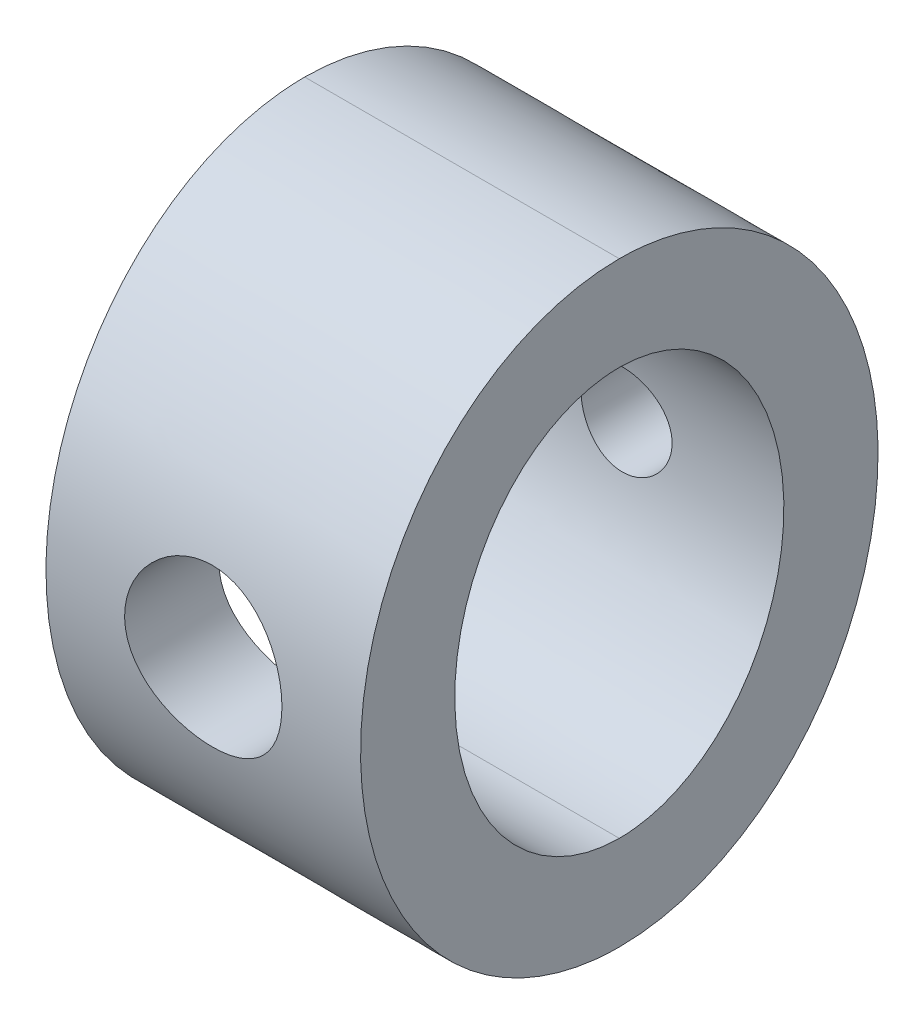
ISO-10303-21;
HEADER;
FILE_DESCRIPTION(('STEP AP214'),'2;1');
FILE_NAME('part.step','',(''),(''),'','','');
FILE_SCHEMA(('AUTOMOTIVE_DESIGN { 1 0 10303 214 1 1 1 1 }'));
ENDSEC;
DATA;
#1=APPLICATION_CONTEXT('core data for automotive mechanical design processes');
#2=APPLICATION_PROTOCOL_DEFINITION('international standard','automotive_design',2000,#1);
#3=PRODUCT_CONTEXT('',#1,'mechanical');
#4=PRODUCT('Part','Part','',(#3));
#5=PRODUCT_RELATED_PRODUCT_CATEGORY('part','',(#4));
#6=PRODUCT_DEFINITION_FORMATION('','',#4);
#7=PRODUCT_DEFINITION_CONTEXT('part definition',#1,'design');
#8=PRODUCT_DEFINITION('design','',#6,#7);
#9=PRODUCT_DEFINITION_SHAPE('','',#8);
#10=(LENGTH_UNIT() NAMED_UNIT(*) SI_UNIT(.MILLI.,.METRE.));
#11=(NAMED_UNIT(*) PLANE_ANGLE_UNIT() SI_UNIT($,.RADIAN.));
#12=(NAMED_UNIT(*) SI_UNIT($,.STERADIAN.) SOLID_ANGLE_UNIT());
#13=UNCERTAINTY_MEASURE_WITH_UNIT(LENGTH_MEASURE(1.E-05),#10,'distance_accuracy_value','');
#14=(GEOMETRIC_REPRESENTATION_CONTEXT(3) GLOBAL_UNCERTAINTY_ASSIGNED_CONTEXT((#13)) GLOBAL_UNIT_ASSIGNED_CONTEXT((#10,
#11,#12)) REPRESENTATION_CONTEXT('',''));
#15=CARTESIAN_POINT('',(0.,0.,0.));
#16=DIRECTION('',(0.,0.,1.));
#17=DIRECTION('',(1.,0.,0.));
#18=AXIS2_PLACEMENT_3D('',#15,#16,#17);
#19=CARTESIAN_POINT('',(0.,0.,31.75));
#20=DIRECTION('',(0.,0.,-1.));
#21=DIRECTION('',(0.,1.,0.));
#22=AXIS2_PLACEMENT_3D('',#19,#20,#21);
#23=CYLINDRICAL_SURFACE('',#22,4.826);
#24=CARTESIAN_POINT('',(2.86576318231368E-12,-4.826,31.1872802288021));
#25=CARTESIAN_POINT('',(0.133500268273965,-4.82599943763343,31.1872805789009));
#26=CARTESIAN_POINT('',(0.267014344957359,-4.82045580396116,31.1885994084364));
#27=CARTESIAN_POINT('',(0.533123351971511,-4.79832185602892,31.1938363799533));
#28=CARTESIAN_POINT('',(0.665717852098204,-4.78172668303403,31.1977556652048));
#29=CARTESIAN_POINT('',(0.929181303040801,-4.73759055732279,31.2080828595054));
#30=CARTESIAN_POINT('',(1.06004734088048,-4.71003308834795,31.2144945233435));
#31=CARTESIAN_POINT('',(1.3189662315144,-4.64418512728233,31.229615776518));
#32=CARTESIAN_POINT('',(1.44701798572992,-4.60589052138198,31.2383262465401));
#33=CARTESIAN_POINT('',(1.69910683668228,-4.51896578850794,31.2577649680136));
#34=CARTESIAN_POINT('',(1.82315166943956,-4.47035714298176,31.2684890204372));
#35=CARTESIAN_POINT('',(2.06671112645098,-4.36310601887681,31.2916593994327));
#36=CARTESIAN_POINT('',(2.18622405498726,-4.30445982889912,31.3041063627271));
#37=CARTESIAN_POINT('',(2.41980518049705,-4.17761531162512,31.3303560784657));
#38=CARTESIAN_POINT('',(2.5338769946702,-4.10942345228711,31.3441579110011));
#39=CARTESIAN_POINT('',(2.75596752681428,-3.96390603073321,31.3727446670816));
#40=CARTESIAN_POINT('',(2.86398395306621,-3.88657704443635,31.3875299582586));
#41=CARTESIAN_POINT('',(3.07497837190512,-3.72195996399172,31.4179257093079));
#42=CARTESIAN_POINT('',(3.17784200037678,-3.63452703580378,31.4335458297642));
#43=CARTESIAN_POINT('',(3.37591031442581,-3.45133456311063,31.4649479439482));
#44=CARTESIAN_POINT('',(3.47111214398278,-3.35557194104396,31.4807299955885));
#45=CARTESIAN_POINT('',(3.65315967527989,-3.15640587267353,31.5120102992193));
#46=CARTESIAN_POINT('',(3.74000729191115,-3.05300418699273,31.5275086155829));
#47=CARTESIAN_POINT('',(3.90481001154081,-2.83918321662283,31.5578049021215));
#48=CARTESIAN_POINT('',(3.98276182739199,-2.72876136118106,31.5726026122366));
#49=CARTESIAN_POINT('',(4.13001098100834,-2.50038996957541,31.6012453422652));
#50=CARTESIAN_POINT('',(4.19920137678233,-2.38236986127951,31.6150778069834));
#51=CARTESIAN_POINT('',(4.32739928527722,-2.14070267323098,31.641220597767));
#52=CARTESIAN_POINT('',(4.38640296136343,-2.01705349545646,31.6535303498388));
#53=CARTESIAN_POINT('',(4.49371192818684,-1.76509715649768,31.6762676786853));
#54=CARTESIAN_POINT('',(4.54202229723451,-1.63679224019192,31.6866961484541));
#55=CARTESIAN_POINT('',(4.6276064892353,-1.37634763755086,31.7053846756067));
#56=CARTESIAN_POINT('',(4.6648763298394,-1.24420658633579,31.7136439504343));
#57=CARTESIAN_POINT('',(4.7274841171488,-0.979456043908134,31.7276259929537));
#58=CARTESIAN_POINT('',(4.75302113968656,-0.84689602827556,31.7333909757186));
#59=CARTESIAN_POINT('',(4.79292291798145,-0.580008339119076,31.7424390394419));
#60=CARTESIAN_POINT('',(4.80728356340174,-0.445680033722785,31.7457212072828));
#61=CARTESIAN_POINT('',(4.8333384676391,-0.0416504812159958,31.7516705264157));
#62=CARTESIAN_POINT('',(4.82808263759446,0.229421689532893,31.7504580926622));
#63=CARTESIAN_POINT('',(4.7729213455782,0.761460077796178,31.737888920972));
#64=CARTESIAN_POINT('',(4.72384779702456,1.02252048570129,31.7267211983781));
#65=CARTESIAN_POINT('',(4.58379599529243,1.53264507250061,31.6957094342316));
#66=CARTESIAN_POINT('',(4.49281550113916,1.78170860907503,31.6758649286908));
#67=CARTESIAN_POINT('',(4.27084792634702,2.26295611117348,31.6294108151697));
#68=CARTESIAN_POINT('',(4.13955224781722,2.49499214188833,31.6027492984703));
#69=CARTESIAN_POINT('',(3.84079455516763,2.93411173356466,31.5455366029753));
#70=CARTESIAN_POINT('',(3.67332963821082,3.14119328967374,31.5149851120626));
#71=CARTESIAN_POINT('',(3.39651478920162,3.43109949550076,31.4683448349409));
#72=CARTESIAN_POINT('',(3.2986996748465,3.5252358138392,31.4524759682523));
#73=CARTESIAN_POINT('',(3.09547681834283,3.70495166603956,31.4210160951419));
#74=CARTESIAN_POINT('',(2.99007178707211,3.79053422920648,31.4054249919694));
#75=CARTESIAN_POINT('',(2.77227517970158,3.95262155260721,31.3749485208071));
#76=CARTESIAN_POINT('',(2.65987789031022,4.02911873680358,31.3600637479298));
#77=CARTESIAN_POINT('',(2.42896608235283,4.17239155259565,31.3314475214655));
#78=CARTESIAN_POINT('',(2.31045393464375,4.23917091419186,31.3177156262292));
#79=CARTESIAN_POINT('',(2.06748156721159,4.36285124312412,31.2917386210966));
#80=CARTESIAN_POINT('',(1.94299492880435,4.41970194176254,31.2795011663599));
#81=CARTESIAN_POINT('',(1.68953985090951,4.52265765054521,31.2569672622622));
#82=CARTESIAN_POINT('',(1.56057320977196,4.56876691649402,31.2466700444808));
#83=CARTESIAN_POINT('',(1.29925930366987,4.64982636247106,31.2283438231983));
#84=CARTESIAN_POINT('',(1.16691802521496,4.68479499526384,31.2203110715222));
#85=CARTESIAN_POINT('',(0.899673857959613,4.74337036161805,31.2067461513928));
#86=CARTESIAN_POINT('',(0.764772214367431,4.7669824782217,31.2012127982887));
#87=CARTESIAN_POINT('',(0.524863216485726,4.79852579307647,31.1937898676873));
#88=CARTESIAN_POINT('',(0.420177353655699,4.80882349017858,31.1913528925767));
#89=CARTESIAN_POINT('',(0.210330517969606,4.82256082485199,31.1880979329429));
#90=CARTESIAN_POINT('',(0.10516954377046,4.82600044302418,31.1872799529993));
#91=CARTESIAN_POINT('',(-0.133500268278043,4.82599943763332,31.1872805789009));
#92=CARTESIAN_POINT('',(-0.26701434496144,4.82045580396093,31.1885994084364));
#93=CARTESIAN_POINT('',(-0.533123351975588,4.79832185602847,31.1938363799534));
#94=CARTESIAN_POINT('',(-0.665717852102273,4.78172668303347,31.1977556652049));
#95=CARTESIAN_POINT('',(-0.929181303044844,4.737590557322,31.2080828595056));
#96=CARTESIAN_POINT('',(-1.06004734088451,4.71003308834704,31.2144945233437));
#97=CARTESIAN_POINT('',(-1.31896623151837,4.6441851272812,31.2296157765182));
#98=CARTESIAN_POINT('',(-1.44701798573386,4.60589052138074,31.2383262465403));
#99=CARTESIAN_POINT('',(-1.69910683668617,4.51896578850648,31.257764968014));
#100=CARTESIAN_POINT('',(-1.82315166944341,4.4703571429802,31.2684890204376));
#101=CARTESIAN_POINT('',(-2.06671112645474,4.36310601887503,31.2916593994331));
#102=CARTESIAN_POINT('',(-2.18622405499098,4.30445982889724,31.3041063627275));
#103=CARTESIAN_POINT('',(-2.41980518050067,4.17761531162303,31.3303560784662));
#104=CARTESIAN_POINT('',(-2.53387699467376,4.10942345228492,31.3441579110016));
#105=CARTESIAN_POINT('',(-2.75596752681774,3.96390603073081,31.372744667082));
#106=CARTESIAN_POINT('',(-2.8639839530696,3.88657704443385,31.3875299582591));
#107=CARTESIAN_POINT('',(-3.07497837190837,3.72195996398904,31.4179257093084));
#108=CARTESIAN_POINT('',(-3.17784200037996,3.634527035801,31.4335458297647));
#109=CARTESIAN_POINT('',(-3.37591031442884,3.45133456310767,31.4649479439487));
#110=CARTESIAN_POINT('',(-3.47111214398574,3.3555719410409,31.480729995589));
#111=CARTESIAN_POINT('',(-3.65315967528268,3.1564058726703,31.5120102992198));
#112=CARTESIAN_POINT('',(-3.74000729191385,3.05300418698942,31.5275086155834));
#113=CARTESIAN_POINT('',(-3.90481001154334,2.83918321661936,31.557804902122));
#114=CARTESIAN_POINT('',(-3.98276182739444,2.72876136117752,31.572602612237));
#115=CARTESIAN_POINT('',(-4.13001098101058,2.50038996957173,31.6012453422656));
#116=CARTESIAN_POINT('',(-4.19920137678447,2.38236986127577,31.6150778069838));
#117=CARTESIAN_POINT('',(-4.32739928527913,2.14070267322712,31.6412205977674));
#118=CARTESIAN_POINT('',(-4.38640296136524,2.01705349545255,31.6535303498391));
#119=CARTESIAN_POINT('',(-4.49371192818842,1.76509715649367,31.6762676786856));
#120=CARTESIAN_POINT('',(-4.54202229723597,1.63679224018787,31.6866961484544));
#121=CARTESIAN_POINT('',(-4.62760648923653,1.37634763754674,31.7053846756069));
#122=CARTESIAN_POINT('',(-4.66487632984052,1.24420658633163,31.7136439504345));
#123=CARTESIAN_POINT('',(-4.72748411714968,0.979456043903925,31.7276259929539));
#124=CARTESIAN_POINT('',(-4.75302113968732,0.846896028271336,31.7333909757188));
#125=CARTESIAN_POINT('',(-4.79292291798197,0.580008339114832,31.742439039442));
#126=CARTESIAN_POINT('',(-4.80728356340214,0.445680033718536,31.7457212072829));
#127=CARTESIAN_POINT('',(-4.83333846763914,0.0416504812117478,31.7516705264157));
#128=CARTESIAN_POINT('',(-4.82808263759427,-0.229421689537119,31.7504580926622));
#129=CARTESIAN_POINT('',(-4.77292134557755,-0.76146007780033,31.7378889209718));
#130=CARTESIAN_POINT('',(-4.72384779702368,-1.02252048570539,31.7267211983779));
#131=CARTESIAN_POINT('',(-4.5837959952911,-1.53264507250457,31.6957094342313));
#132=CARTESIAN_POINT('',(-4.49281550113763,-1.78170860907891,31.6758649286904));
#133=CARTESIAN_POINT('',(-4.27084792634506,-2.26295611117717,31.6294108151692));
#134=CARTESIAN_POINT('',(-4.13955224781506,-2.49499214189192,31.6027492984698));
#135=CARTESIAN_POINT('',(-3.84079455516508,-2.93411173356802,31.5455366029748));
#136=CARTESIAN_POINT('',(-3.67332963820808,-3.14119328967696,31.5149851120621));
#137=CARTESIAN_POINT('',(-3.39651478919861,-3.43109949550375,31.4683448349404));
#138=CARTESIAN_POINT('',(-3.2986996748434,-3.52523581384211,31.4524759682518));
#139=CARTESIAN_POINT('',(-3.09547681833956,-3.70495166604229,31.4210160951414));
#140=CARTESIAN_POINT('',(-2.99007178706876,-3.79053422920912,31.4054249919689));
#141=CARTESIAN_POINT('',(-2.77227517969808,-3.95262155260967,31.3749485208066));
#142=CARTESIAN_POINT('',(-2.65987789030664,-4.02911873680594,31.3600637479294));
#143=CARTESIAN_POINT('',(-2.42896608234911,-4.17239155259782,31.3314475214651));
#144=CARTESIAN_POINT('',(-2.31045393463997,-4.23917091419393,31.3177156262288));
#145=CARTESIAN_POINT('',(-2.06748156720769,-4.36285124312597,31.2917386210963));
#146=CARTESIAN_POINT('',(-1.9429949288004,-4.41970194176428,31.2795011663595));
#147=CARTESIAN_POINT('',(-1.68953985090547,-4.52265765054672,31.2569672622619));
#148=CARTESIAN_POINT('',(-1.56057320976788,-4.56876691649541,31.2466700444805));
#149=CARTESIAN_POINT('',(-1.29925930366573,-4.64982636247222,31.228343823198));
#150=CARTESIAN_POINT('',(-1.16691802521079,-4.68479499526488,31.220311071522));
#151=CARTESIAN_POINT('',(-0.899673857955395,-4.74337036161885,31.2067461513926));
#152=CARTESIAN_POINT('',(-0.764772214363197,-4.76698247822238,31.2012127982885));
#153=CARTESIAN_POINT('',(-0.524863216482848,-4.79852579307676,31.1937898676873));
#154=CARTESIAN_POINT('',(-0.420177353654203,-4.80882349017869,31.1913528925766));
#155=CARTESIAN_POINT('',(-0.210330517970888,-4.8225608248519,31.1880979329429));
#156=CARTESIAN_POINT('',(-0.105169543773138,-4.8260004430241,31.1872799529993));
#157=CARTESIAN_POINT('',(2.86576318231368E-12,-4.826,31.1872802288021));
#158=B_SPLINE_CURVE_WITH_KNOTS('',3,(#24,#25,#26,#27,#28,#29,#30,#31,#32,#33,#34,#35,#36,#37,
#38,#39,#40,#41,#42,#43,#44,#45,#46,#47,#48,#49,#50,#51,#52,#53,#54,#55,#56,#57,#58,#59,#60,#61,
#62,#63,#64,#65,#66,#67,#68,#69,#70,#71,#72,#73,#74,#75,#76,#77,#78,#79,#80,#81,#82,#83,#84,#85,
#86,#87,#88,#89,#90,#91,#92,#93,#94,#95,#96,#97,#98,#99,#100,#101,#102,#103,#104,#105,#106,#107,
#108,#109,#110,#111,#112,#113,#114,#115,#116,#117,#118,#119,#120,#121,#122,#123,#124,#125,#126,
#127,#128,#129,#130,#131,#132,#133,#134,#135,#136,#137,#138,#139,#140,#141,#142,#143,#144,#145,
#146,#147,#148,#149,#150,#151,#152,#153,#154,#155,#156,#157),.UNSPECIFIED.,.T.,.F.,(4,2,2,2,2,2,
2,2,2,2,2,2,2,2,2,2,2,2,2,2,2,2,2,2,2,2,2,2,2,2,2,2,2,2,2,2,2,2,2,2,2,2,2,2,2,2,2,2,2,2,2,2,2,2,
2,2,2,2,2,2,2,2,2,2,2,2,4),(0.,0.400403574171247,0.800983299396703,1.20216885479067,
1.60350833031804,2.00401998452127,2.40468004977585,2.80506993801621,3.20561034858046,
3.61284430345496,4.02022936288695,4.42752082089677,4.83496229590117,5.24697626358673,
5.65914507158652,6.07111771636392,6.48323878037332,6.88808247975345,7.29307499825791,
8.10206612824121,8.8960170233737,9.69001037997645,10.4902397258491,11.2905333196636,
11.7001760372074,12.1096731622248,12.5195093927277,12.9291878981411,13.3408839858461,
13.7524166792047,14.1632641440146,14.5739166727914,14.8893478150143,15.2047798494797,
15.6051834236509,16.0057631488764,16.4069487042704,16.8082881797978,17.208799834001,
17.6094598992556,18.009849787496,18.4103901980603,18.8176241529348,19.2250092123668,
19.6323006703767,20.0397421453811,20.4517561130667,20.8639249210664,21.2758975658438,
21.6880186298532,22.0928623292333,22.4978548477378,23.306845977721,24.1007968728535,
24.8947902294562,25.6950195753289,26.4953131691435,26.9049558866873,27.3144530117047,
27.7242892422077,28.133967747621,28.545663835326,28.9571965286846,29.3680439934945,
29.7786965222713,30.09412766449,30.4095596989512),.UNSPECIFIED.);
#159=CARTESIAN_POINT('',(2.86576318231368E-12,-4.826,31.1872802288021));
#160=VERTEX_POINT('',#159);
#161=EDGE_CURVE('E81',#160,#160,#158,.T.);
#162=ORIENTED_EDGE('',*,*,#161,.T.);
#163=EDGE_LOOP('',(#162));
#164=FACE_BOUND('',#163,.T.);
#165=CARTESIAN_POINT('',(0.,4.826,25.1899093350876));
#166=CARTESIAN_POINT('',(-0.131692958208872,4.82599979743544,25.1899095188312));
#167=CARTESIAN_POINT('',(-0.263390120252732,4.82060481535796,25.1917338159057));
#168=CARTESIAN_POINT('',(-0.525852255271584,4.79907295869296,25.1989720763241));
#169=CARTESIAN_POINT('',(-0.656616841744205,4.78293186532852,25.2043874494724));
#170=CARTESIAN_POINT('',(-0.916381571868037,4.74002880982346,25.2186404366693));
#171=CARTESIAN_POINT('',(-1.04537911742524,4.71325265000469,25.2274826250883));
#172=CARTESIAN_POINT('',(-1.3005632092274,4.64931423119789,25.2483071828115));
#173=CARTESIAN_POINT('',(-1.426748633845,4.6121479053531,25.260290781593));
#174=CARTESIAN_POINT('',(-1.67505096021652,4.52787088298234,25.286984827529));
#175=CARTESIAN_POINT('',(-1.79717852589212,4.48078911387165,25.3016873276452));
#176=CARTESIAN_POINT('',(-2.03697897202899,4.37699505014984,25.3334001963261));
#177=CARTESIAN_POINT('',(-2.15465017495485,4.32027917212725,25.3504114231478));
#178=CARTESIAN_POINT('',(-2.49972645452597,4.1363598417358,25.4041623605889));
#179=CARTESIAN_POINT('',(-2.71948485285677,3.9952854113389,25.4436523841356));
#180=CARTESIAN_POINT('',(-3.13987602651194,3.6747254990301,25.5270335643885));
#181=CARTESIAN_POINT('',(-3.33964174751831,3.49412903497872,25.5710267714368));
#182=CARTESIAN_POINT('',(-3.61475841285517,3.20029264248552,25.6358554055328));
#183=CARTESIAN_POINT('',(-3.70242104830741,3.09845478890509,25.6572840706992));
#184=CARTESIAN_POINT('',(-3.86902895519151,2.88771668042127,25.6991960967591));
#185=CARTESIAN_POINT('',(-3.94797726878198,2.77881891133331,25.7196797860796));
#186=CARTESIAN_POINT('',(-4.09831479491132,2.55206260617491,25.7596125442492));
#187=CARTESIAN_POINT('',(-4.16948984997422,2.43405609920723,25.7790272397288));
#188=CARTESIAN_POINT('',(-4.30158137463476,2.19217955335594,25.8157579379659));
#189=CARTESIAN_POINT('',(-4.36250192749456,2.06831187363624,25.8330747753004));
#190=CARTESIAN_POINT('',(-4.47362320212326,1.81550026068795,25.8651385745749));
#191=CARTESIAN_POINT('',(-4.5238214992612,1.68655518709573,25.8798849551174));
#192=CARTESIAN_POINT('',(-4.6130148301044,1.42460631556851,25.9063804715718));
#193=CARTESIAN_POINT('',(-4.65201478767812,1.29160432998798,25.9181309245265));
#194=CARTESIAN_POINT('',(-4.7174357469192,1.02669662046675,25.9379921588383));
#195=CARTESIAN_POINT('',(-4.74421099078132,0.894885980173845,25.9462049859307));
#196=CARTESIAN_POINT('',(-4.78667162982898,0.629377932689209,25.9592843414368));
#197=CARTESIAN_POINT('',(-4.80236149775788,0.49568130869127,25.9641522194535));
#198=CARTESIAN_POINT('',(-4.82251826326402,0.227363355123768,25.9704134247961));
#199=CARTESIAN_POINT('',(-4.82698515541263,0.0927420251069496,25.9718067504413));
#200=CARTESIAN_POINT('',(-4.82465235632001,-0.176392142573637,25.9710803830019));
#201=CARTESIAN_POINT('',(-4.81785288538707,-0.310904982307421,25.9689607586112));
#202=CARTESIAN_POINT('',(-4.79347881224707,-0.574209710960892,25.961399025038));
#203=CARTESIAN_POINT('',(-4.7762804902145,-0.703039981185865,25.9560729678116));
#204=CARTESIAN_POINT('',(-4.7315827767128,-0.95877832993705,25.9423328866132));
#205=CARTESIAN_POINT('',(-4.70407988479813,-1.08568574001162,25.9339178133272));
#206=CARTESIAN_POINT('',(-4.63902089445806,-1.33662138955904,25.9142161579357));
#207=CARTESIAN_POINT('',(-4.60146808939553,-1.46065055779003,25.9029305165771));
#208=CARTESIAN_POINT('',(-4.51659789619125,-1.70510001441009,25.8777639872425));
#209=CARTESIAN_POINT('',(-4.46927683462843,-1.82551892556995,25.863882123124));
#210=CARTESIAN_POINT('',(-4.36464954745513,-2.06329205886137,25.833696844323));
#211=CARTESIAN_POINT('',(-4.30723512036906,-2.18059535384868,25.8173675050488));
#212=CARTESIAN_POINT('',(-4.18320813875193,-2.40999036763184,25.7828098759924));
#213=CARTESIAN_POINT('',(-4.11659243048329,-2.52208028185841,25.7645809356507));
#214=CARTESIAN_POINT('',(-3.97464341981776,-2.74033422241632,25.7266814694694));
#215=CARTESIAN_POINT('',(-3.89931028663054,-2.84649836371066,25.7070109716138));
#216=CARTESIAN_POINT('',(-3.74041627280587,-3.05228812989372,25.6667146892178));
#217=CARTESIAN_POINT('',(-3.65685512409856,-3.15191354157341,25.6460888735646));
#218=CARTESIAN_POINT('',(-3.47839284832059,-3.34803794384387,25.6035298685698));
#219=CARTESIAN_POINT('',(-3.38316515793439,-3.44423595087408,25.5815779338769));
#220=CARTESIAN_POINT('',(-3.18498711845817,-3.62827984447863,25.5378013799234));
#221=CARTESIAN_POINT('',(-3.08203922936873,-3.71612837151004,25.5159767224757));
#222=CARTESIAN_POINT('',(-2.86894271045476,-3.88301091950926,25.4730380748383));
#223=CARTESIAN_POINT('',(-2.75878795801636,-3.96203728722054,25.4519247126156));
#224=CARTESIAN_POINT('',(-2.53208818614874,-4.11061615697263,25.4110450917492));
#225=CARTESIAN_POINT('',(-2.41554567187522,-4.18017233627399,25.3912783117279));
#226=CARTESIAN_POINT('',(-2.17513364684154,-4.31022051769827,25.3534159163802));
#227=CARTESIAN_POINT('',(-2.05118565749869,-4.37057535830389,25.3353468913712));
#228=CARTESIAN_POINT('',(-1.79833492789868,-4.48054294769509,25.3017764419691));
#229=CARTESIAN_POINT('',(-1.66943426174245,-4.53016013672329,25.286273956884));
#230=CARTESIAN_POINT('',(-1.40776733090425,-4.6181694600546,25.2583678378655));
#231=CARTESIAN_POINT('',(-1.27500783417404,-4.65658008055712,25.2459591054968));
#232=CARTESIAN_POINT('',(-1.0064711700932,-4.72190367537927,25.2246414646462));
#233=CARTESIAN_POINT('',(-0.870695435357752,-4.74882199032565,25.2157309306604));
#234=CARTESIAN_POINT('',(-0.612656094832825,-4.78852655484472,25.2025130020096));
#235=CARTESIAN_POINT('',(-0.49060498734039,-4.8025686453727,25.1977983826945));
#236=CARTESIAN_POINT('',(-0.245703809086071,-4.82130548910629,25.1914964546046));
#237=CARTESIAN_POINT('',(-0.12285373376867,-4.82600018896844,25.1899091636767));
#238=CARTESIAN_POINT('',(0.131692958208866,-4.82599979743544,25.1899095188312));
#239=CARTESIAN_POINT('',(0.263390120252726,-4.82060481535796,25.1917338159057));
#240=CARTESIAN_POINT('',(0.525852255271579,-4.79907295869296,25.1989720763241));
#241=CARTESIAN_POINT('',(0.656616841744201,-4.78293186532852,25.2043874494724));
#242=CARTESIAN_POINT('',(0.916381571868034,-4.74002880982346,25.2186404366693));
#243=CARTESIAN_POINT('',(1.04537911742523,-4.71325265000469,25.2274826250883));
#244=CARTESIAN_POINT('',(1.3005632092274,-4.64931423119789,25.2483071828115));
#245=CARTESIAN_POINT('',(1.426748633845,-4.6121479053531,25.260290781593));
#246=CARTESIAN_POINT('',(1.67505096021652,-4.52787088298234,25.286984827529));
#247=CARTESIAN_POINT('',(1.79717852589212,-4.48078911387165,25.3016873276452));
#248=CARTESIAN_POINT('',(2.03697897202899,-4.37699505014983,25.3334001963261));
#249=CARTESIAN_POINT('',(2.15465017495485,-4.32027917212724,25.3504114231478));
#250=CARTESIAN_POINT('',(2.49972645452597,-4.1363598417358,25.4041623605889));
#251=CARTESIAN_POINT('',(2.71948485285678,-3.99528541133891,25.4436523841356));
#252=CARTESIAN_POINT('',(3.13987602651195,-3.67472549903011,25.5270335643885));
#253=CARTESIAN_POINT('',(3.33964174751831,-3.49412903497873,25.5710267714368));
#254=CARTESIAN_POINT('',(3.61475841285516,-3.20029264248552,25.6358554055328));
#255=CARTESIAN_POINT('',(3.7024210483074,-3.09845478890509,25.6572840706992));
#256=CARTESIAN_POINT('',(3.86902895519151,-2.88771668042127,25.6991960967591));
#257=CARTESIAN_POINT('',(3.94797726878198,-2.77881891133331,25.7196797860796));
#258=CARTESIAN_POINT('',(4.09831479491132,-2.55206260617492,25.7596125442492));
#259=CARTESIAN_POINT('',(4.16948984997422,-2.43405609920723,25.7790272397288));
#260=CARTESIAN_POINT('',(4.30158137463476,-2.19217955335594,25.8157579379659));
#261=CARTESIAN_POINT('',(4.36250192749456,-2.06831187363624,25.8330747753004));
#262=CARTESIAN_POINT('',(4.47362320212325,-1.81550026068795,25.8651385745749));
#263=CARTESIAN_POINT('',(4.5238214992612,-1.68655518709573,25.8798849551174));
#264=CARTESIAN_POINT('',(4.61301483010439,-1.42460631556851,25.9063804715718));
#265=CARTESIAN_POINT('',(4.65201478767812,-1.29160432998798,25.9181309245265));
#266=CARTESIAN_POINT('',(4.7174357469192,-1.02669662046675,25.9379921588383));
#267=CARTESIAN_POINT('',(4.74421099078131,-0.894885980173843,25.9462049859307));
#268=CARTESIAN_POINT('',(4.78667162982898,-0.629377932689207,25.9592843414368));
#269=CARTESIAN_POINT('',(4.80236149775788,-0.495681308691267,25.9641522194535));
#270=CARTESIAN_POINT('',(4.82251826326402,-0.227363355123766,25.9704134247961));
#271=CARTESIAN_POINT('',(4.82698515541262,-0.0927420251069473,25.9718067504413));
#272=CARTESIAN_POINT('',(4.82465235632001,0.176392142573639,25.9710803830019));
#273=CARTESIAN_POINT('',(4.81785288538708,0.310904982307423,25.9689607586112));
#274=CARTESIAN_POINT('',(4.79347881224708,0.574209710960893,25.961399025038));
#275=CARTESIAN_POINT('',(4.7762804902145,0.703039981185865,25.9560729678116));
#276=CARTESIAN_POINT('',(4.73158277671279,0.958778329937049,25.9423328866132));
#277=CARTESIAN_POINT('',(4.70407988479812,1.08568574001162,25.9339178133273));
#278=CARTESIAN_POINT('',(4.63902089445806,1.33662138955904,25.9142161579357));
#279=CARTESIAN_POINT('',(4.60146808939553,1.46065055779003,25.9029305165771));
#280=CARTESIAN_POINT('',(4.51659789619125,1.70510001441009,25.8777639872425));
#281=CARTESIAN_POINT('',(4.46927683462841,1.82551892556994,25.863882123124));
#282=CARTESIAN_POINT('',(4.36464954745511,2.06329205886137,25.833696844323));
#283=CARTESIAN_POINT('',(4.30723512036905,2.18059535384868,25.8173675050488));
#284=CARTESIAN_POINT('',(4.18320813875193,2.40999036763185,25.7828098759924));
#285=CARTESIAN_POINT('',(4.11659243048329,2.52208028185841,25.7645809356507));
#286=CARTESIAN_POINT('',(3.97464341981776,2.74033422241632,25.7266814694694));
#287=CARTESIAN_POINT('',(3.89931028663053,2.84649836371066,25.7070109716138));
#288=CARTESIAN_POINT('',(3.74041627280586,3.05228812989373,25.6667146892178));
#289=CARTESIAN_POINT('',(3.65685512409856,3.15191354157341,25.6460888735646));
#290=CARTESIAN_POINT('',(3.47839284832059,3.34803794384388,25.6035298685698));
#291=CARTESIAN_POINT('',(3.38316515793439,3.44423595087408,25.5815779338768));
#292=CARTESIAN_POINT('',(3.18498711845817,3.62827984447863,25.5378013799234));
#293=CARTESIAN_POINT('',(3.08203922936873,3.71612837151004,25.5159767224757));
#294=CARTESIAN_POINT('',(2.86894271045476,3.88301091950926,25.4730380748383));
#295=CARTESIAN_POINT('',(2.75878795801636,3.96203728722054,25.4519247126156));
#296=CARTESIAN_POINT('',(2.53208818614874,4.11061615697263,25.4110450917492));
#297=CARTESIAN_POINT('',(2.41554567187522,4.18017233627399,25.3912783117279));
#298=CARTESIAN_POINT('',(2.17513364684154,4.31022051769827,25.3534159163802));
#299=CARTESIAN_POINT('',(2.05118565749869,4.37057535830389,25.3353468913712));
#300=CARTESIAN_POINT('',(1.79833492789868,4.48054294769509,25.3017764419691));
#301=CARTESIAN_POINT('',(1.66943426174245,4.53016013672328,25.286273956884));
#302=CARTESIAN_POINT('',(1.40776733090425,4.6181694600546,25.2583678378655));
#303=CARTESIAN_POINT('',(1.27500783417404,4.65658008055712,25.2459591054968));
#304=CARTESIAN_POINT('',(1.0064711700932,4.72190367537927,25.2246414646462));
#305=CARTESIAN_POINT('',(0.870695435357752,4.74882199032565,25.2157309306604));
#306=CARTESIAN_POINT('',(0.612656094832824,4.78852655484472,25.2025130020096));
#307=CARTESIAN_POINT('',(0.490604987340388,4.8025686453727,25.1977983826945));
#308=CARTESIAN_POINT('',(0.245703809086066,4.82130548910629,25.1914964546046));
#309=CARTESIAN_POINT('',(0.122853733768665,4.82600018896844,25.1899091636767));
#310=CARTESIAN_POINT('',(0.,4.826,25.1899093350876));
#311=B_SPLINE_CURVE_WITH_KNOTS('',3,(#165,#166,#167,#168,#169,#170,#171,#172,#173,#174,#175,
#176,#177,#178,#179,#180,#181,#182,#183,#184,#185,#186,#187,#188,#189,#190,#191,#192,#193,#194,
#195,#196,#197,#198,#199,#200,#201,#202,#203,#204,#205,#206,#207,#208,#209,#210,#211,#212,#213,
#214,#215,#216,#217,#218,#219,#220,#221,#222,#223,#224,#225,#226,#227,#228,#229,#230,#231,#232,
#233,#234,#235,#236,#237,#238,#239,#240,#241,#242,#243,#244,#245,#246,#247,#248,#249,#250,#251,
#252,#253,#254,#255,#256,#257,#258,#259,#260,#261,#262,#263,#264,#265,#266,#267,#268,#269,#270,
#271,#272,#273,#274,#275,#276,#277,#278,#279,#280,#281,#282,#283,#284,#285,#286,#287,#288,#289,
#290,#291,#292,#293,#294,#295,#296,#297,#298,#299,#300,#301,#302,#303,#304,#305,#306,#307,#308,
#309,#310),.UNSPECIFIED.,.T.,.F.,(4,2,2,2,2,2,2,2,2,2,2,2,2,2,2,2,2,2,2,2,2,2,2,2,2,2,2,2,2,2,2,
2,2,2,2,2,2,2,2,2,2,2,2,2,2,2,2,2,2,2,2,2,2,2,2,2,2,2,2,2,2,2,2,2,2,2,2,2,2,2,2,2,4),(0.,
0.394963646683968,0.790082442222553,1.18573049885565,1.58153363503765,1.97619766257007,
2.37100880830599,3.1597155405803,3.97436961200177,4.38219188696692,4.789871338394,
5.2068739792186,5.62371017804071,6.04064053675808,6.45738729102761,6.86114210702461,
7.26473392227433,7.66832593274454,8.07191005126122,8.46169813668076,8.85161875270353,
9.24141174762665,9.63135159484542,10.0257595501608,10.4203030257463,10.8148388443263,
11.2093875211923,11.6202980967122,12.0310782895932,12.4422121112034,12.8531858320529,
13.2697871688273,13.6862159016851,14.101953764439,14.5174982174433,14.8859498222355,
15.2544035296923,15.6493671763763,16.0444859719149,16.440134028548,16.83593716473,
17.2306011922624,17.6254123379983,18.4141190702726,19.2287731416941,19.6365954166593,
20.0442748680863,20.4612775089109,20.878113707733,21.2950440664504,21.71179082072,
22.115545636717,22.5191374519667,22.9227294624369,23.3263135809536,23.7161016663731,
24.1060222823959,24.495815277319,24.8857551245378,25.2801630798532,25.6747065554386,
26.0692423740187,26.4637910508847,26.8747016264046,27.2854818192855,27.6966156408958,
28.1075893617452,28.5241906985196,28.9406194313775,29.3563572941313,29.7719017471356,
30.1403533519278,30.5088070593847),.UNSPECIFIED.);
#312=CARTESIAN_POINT('',(0.,4.826,25.1899093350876));
#313=VERTEX_POINT('',#312);
#314=EDGE_CURVE('E18',#313,#313,#311,.T.);
#315=ORIENTED_EDGE('',*,*,#314,.F.);
#316=EDGE_LOOP('',(#315));
#317=FACE_BOUND('',#316,.T.);
#318=ADVANCED_FACE('F14',(#164,#317),#23,.F.);
#319=CARTESIAN_POINT('',(9.652,12.5095,15.875));
#320=CARTESIAN_POINT('',(-9.652,12.5095,15.875));
#321=CARTESIAN_POINT('',(9.652,12.5095,36.068));
#322=CARTESIAN_POINT('',(-9.652,12.5095,36.068));
#323=CARTESIAN_POINT('',(9.652,-12.5095,36.068));
#324=CARTESIAN_POINT('',(-9.652,-12.5095,36.068));
#325=CARTESIAN_POINT('',(9.652,-12.5095,15.875));
#326=CARTESIAN_POINT('',(-9.652,-12.5095,15.875));
#327=(BOUNDED_SURFACE() B_SPLINE_SURFACE(3,1,((#319,#320),(#321,#322),(#323,#324),(#325,#326)),
.UNSPECIFIED.,.F.,.F.,.F.) B_SPLINE_SURFACE_WITH_KNOTS((4,4),(2,2),(0.,1.),(0.,1.),
.UNSPECIFIED.) GEOMETRIC_REPRESENTATION_ITEM() RATIONAL_B_SPLINE_SURFACE(((1.,1.),
(0.333333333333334,0.333333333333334),(0.333333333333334,0.333333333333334),(1.,1.))) REPRESENTATION_ITEM('') SURFACE());
#328=CARTESIAN_POINT('',(-9.652,-12.5095,15.875));
#329=CARTESIAN_POINT('',(-9.652,-12.5095013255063,15.9949500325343));
#330=CARTESIAN_POINT('',(-9.652,-12.5068509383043,16.1148840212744));
#331=CARTESIAN_POINT('',(-9.652,-12.4962667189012,16.3545139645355));
#332=CARTESIAN_POINT('',(-9.652,-12.4883330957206,16.4742099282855));
#333=CARTESIAN_POINT('',(-9.652,-12.4566509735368,16.8324883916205));
#334=CARTESIAN_POINT('',(-9.652,-12.4250211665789,17.070420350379));
#335=CARTESIAN_POINT('',(-9.652,-12.3414541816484,17.5413458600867));
#336=CARTESIAN_POINT('',(-9.652,-12.2896253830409,17.7743588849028));
#337=CARTESIAN_POINT('',(-9.652,-12.1664175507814,18.2351705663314));
#338=CARTESIAN_POINT('',(-9.652,-12.0950372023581,18.462968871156));
#339=CARTESIAN_POINT('',(-9.652,-11.933857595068,18.9115030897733));
#340=CARTESIAN_POINT('',(-9.652,-11.8440893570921,19.1322501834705));
#341=CARTESIAN_POINT('',(-9.652,-11.6471785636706,19.5659341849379));
#342=CARTESIAN_POINT('',(-9.652,-11.5400295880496,19.7788681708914));
#343=CARTESIAN_POINT('',(-9.652,-11.309543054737,20.1959952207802));
#344=CARTESIAN_POINT('',(-9.652,-11.1861923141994,20.4001809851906));
#345=CARTESIAN_POINT('',(-9.652,-10.9246676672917,20.7988359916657));
#346=CARTESIAN_POINT('',(-9.652,-10.7864919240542,20.9933040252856));
#347=CARTESIAN_POINT('',(-9.652,-10.4840352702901,21.3883336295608));
#348=CARTESIAN_POINT('',(-9.652,-10.318529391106,21.5879577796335));
#349=CARTESIAN_POINT('',(-9.652,-9.97322206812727,21.97437704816));
#350=CARTESIAN_POINT('',(-9.652,-9.79341962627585,22.1611712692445));
#351=CARTESIAN_POINT('',(-9.652,-9.23485836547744,22.7017472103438));
#352=CARTESIAN_POINT('',(-9.652,-8.83684529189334,23.0358512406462));
#353=CARTESIAN_POINT('',(-9.652,-7.92551401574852,23.705144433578));
#354=CARTESIAN_POINT('',(-9.652,-7.40435564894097,24.029623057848));
#355=CARTESIAN_POINT('',(-9.652,-6.59300559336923,24.4593949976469));
#356=CARTESIAN_POINT('',(-9.652,-6.31745392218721,24.593221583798));
#357=CARTESIAN_POINT('',(-9.652,-5.75797754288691,24.8420719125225));
#358=CARTESIAN_POINT('',(-9.652,-5.47405195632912,24.9570936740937));
#359=CARTESIAN_POINT('',(-9.652,-4.50059979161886,25.3150451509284));
#360=CARTESIAN_POINT('',(-9.652,-3.79433359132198,25.5142972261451));
#361=CARTESIAN_POINT('',(-9.652,-2.71976830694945,25.7345101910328));
#362=CARTESIAN_POINT('',(-9.652,-2.35882283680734,25.7948166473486));
#363=CARTESIAN_POINT('',(-9.652,-1.63349400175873,25.889438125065));
#364=CARTESIAN_POINT('',(-9.652,-1.26911049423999,25.9237520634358));
#365=CARTESIAN_POINT('',(-9.652,-0.0680851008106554,25.993983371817));
#366=CARTESIAN_POINT('',(-9.652,0.772359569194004,25.9750458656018));
#367=CARTESIAN_POINT('',(-9.652,2.44008050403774,25.8008057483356));
#368=CARTESIAN_POINT('',(-9.652,3.26734299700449,25.6453689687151));
#369=CARTESIAN_POINT('',(-9.652,4.49066949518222,25.3052041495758));
#370=CARTESIAN_POINT('',(-9.652,4.90130639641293,25.1712282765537));
#371=CARTESIAN_POINT('',(-9.652,5.708752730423,24.8660513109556));
#372=CARTESIAN_POINT('',(-9.652,6.10555993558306,24.6948442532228));
#373=CARTESIAN_POINT('',(-9.652,6.8800757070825,24.3152323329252));
#374=CARTESIAN_POINT('',(-9.652,7.25781862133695,24.1068976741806));
#375=CARTESIAN_POINT('',(-9.652,7.98993446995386,23.6526550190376));
#376=CARTESIAN_POINT('',(-9.652,8.34431956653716,23.4067668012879));
#377=CARTESIAN_POINT('',(-9.652,8.91277738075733,22.964270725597));
#378=CARTESIAN_POINT('',(-9.652,9.13483191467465,22.7778484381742));
#379=CARTESIAN_POINT('',(-9.652,9.56381503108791,22.3883649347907));
#380=CARTESIAN_POINT('',(-9.652,9.77074717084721,22.1853076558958));
#381=CARTESIAN_POINT('',(-9.652,10.1673590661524,21.7630153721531));
#382=CARTESIAN_POINT('',(-9.652,10.3570414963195,21.5437828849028));
#383=CARTESIAN_POINT('',(-9.652,10.7169357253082,21.0898287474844));
#384=CARTESIAN_POINT('',(-9.652,10.887147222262,20.8551068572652));
#385=CARTESIAN_POINT('',(-9.652,11.2072817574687,20.3689144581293));
#386=CARTESIAN_POINT('',(-9.652,11.3569936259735,20.1173044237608));
#387=CARTESIAN_POINT('',(-9.652,11.6317303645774,19.6009647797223));
#388=CARTESIAN_POINT('',(-9.652,11.756759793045,19.3362376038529));
#389=CARTESIAN_POINT('',(-9.652,11.9796748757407,18.7961351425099));
#390=CARTESIAN_POINT('',(-9.652,12.0776110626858,18.5207807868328));
#391=CARTESIAN_POINT('',(-9.652,12.2446184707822,17.9616116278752));
#392=CARTESIAN_POINT('',(-9.652,12.3137083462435,17.6778024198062));
#393=CARTESIAN_POINT('',(-9.652,12.4146761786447,17.1412714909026));
#394=CARTESIAN_POINT('',(-9.652,12.4501923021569,16.8892354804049));
#395=CARTESIAN_POINT('',(-9.652,12.4857514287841,16.5096631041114));
#396=CARTESIAN_POINT('',(-9.652,12.4946519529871,16.3829073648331));
#397=CARTESIAN_POINT('',(-9.652,12.5065275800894,16.1291068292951));
#398=CARTESIAN_POINT('',(-9.652,12.5095021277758,16.002062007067));
#399=CARTESIAN_POINT('',(-9.652,12.5095,15.875));
#400=B_SPLINE_CURVE_WITH_KNOTS('',3,(#328,#329,#330,#331,#332,#333,#334,#335,#336,#337,#338,
#339,#340,#341,#342,#343,#344,#345,#346,#347,#348,#349,#350,#351,#352,#353,#354,#355,#356,#357,
#358,#359,#360,#361,#362,#363,#364,#365,#366,#367,#368,#369,#370,#371,#372,#373,#374,#375,#376,
#377,#378,#379,#380,#381,#382,#383,#384,#385,#386,#387,#388,#389,#390,#391,#392,#393,#394,#395,
#396,#397,#398,#399),.UNSPECIFIED.,.F.,.F.,(4,2,2,2,2,2,2,2,2,2,2,2,2,2,2,2,2,2,2,2,2,2,2,2,2,2,
2,2,2,2,2,2,2,2,2,4),(0.,0.359789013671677,0.719563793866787,1.43863836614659,2.15390665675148,
2.86922305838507,3.58334249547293,4.2977263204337,5.01269505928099,5.72775248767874,
6.50490715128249,7.28211611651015,8.83604836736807,10.6707410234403,11.589139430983,
12.5076345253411,14.6991720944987,15.7963074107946,16.8934884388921,19.4037778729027,
21.9165374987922,23.2108419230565,24.505353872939,25.7974435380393,27.0888550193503,
27.9578861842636,28.8267122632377,29.6954033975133,30.5641079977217,31.4411784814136,
32.3180868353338,33.1933484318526,34.0680431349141,34.8304624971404,35.2115440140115,
35.5926612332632),.UNSPECIFIED.);
#401=CARTESIAN_POINT('',(-9.652,-12.5095,15.875));
#402=VERTEX_POINT('',#401);
#403=CARTESIAN_POINT('',(-9.652,12.5095,15.875));
#404=VERTEX_POINT('',#403);
#405=EDGE_CURVE('E160',#402,#404,#400,.T.);
#406=DIRECTION('',(-1.,0.,0.));
#407=VECTOR('',#406,1.);
#408=CARTESIAN_POINT('',(0.,12.5095,15.875));
#409=LINE('',#408,#407);
#410=CARTESIAN_POINT('',(9.652,12.5095,15.875));
#411=VERTEX_POINT('',#410);
#412=EDGE_CURVE('E50',#411,#404,#409,.T.);
#413=CARTESIAN_POINT('',(9.652,-12.5095,15.875));
#414=CARTESIAN_POINT('',(9.652,-12.5095013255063,15.9949500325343));
#415=CARTESIAN_POINT('',(9.652,-12.5068509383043,16.1148840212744));
#416=CARTESIAN_POINT('',(9.652,-12.4962667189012,16.3545139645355));
#417=CARTESIAN_POINT('',(9.652,-12.4883330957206,16.4742099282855));
#418=CARTESIAN_POINT('',(9.652,-12.4566509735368,16.8324883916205));
#419=CARTESIAN_POINT('',(9.652,-12.4250211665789,17.070420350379));
#420=CARTESIAN_POINT('',(9.652,-12.3414541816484,17.5413458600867));
#421=CARTESIAN_POINT('',(9.652,-12.2896253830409,17.7743588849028));
#422=CARTESIAN_POINT('',(9.652,-12.1664175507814,18.2351705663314));
#423=CARTESIAN_POINT('',(9.652,-12.0950372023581,18.462968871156));
#424=CARTESIAN_POINT('',(9.652,-11.933857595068,18.9115030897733));
#425=CARTESIAN_POINT('',(9.652,-11.8440893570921,19.1322501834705));
#426=CARTESIAN_POINT('',(9.652,-11.6471785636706,19.5659341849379));
#427=CARTESIAN_POINT('',(9.652,-11.5400295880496,19.7788681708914));
#428=CARTESIAN_POINT('',(9.652,-11.309543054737,20.1959952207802));
#429=CARTESIAN_POINT('',(9.652,-11.1861923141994,20.4001809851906));
#430=CARTESIAN_POINT('',(9.652,-10.9246676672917,20.7988359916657));
#431=CARTESIAN_POINT('',(9.652,-10.7864919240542,20.9933040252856));
#432=CARTESIAN_POINT('',(9.652,-10.4840352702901,21.3883336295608));
#433=CARTESIAN_POINT('',(9.652,-10.318529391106,21.5879577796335));
#434=CARTESIAN_POINT('',(9.652,-9.97322206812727,21.97437704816));
#435=CARTESIAN_POINT('',(9.652,-9.79341962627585,22.1611712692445));
#436=CARTESIAN_POINT('',(9.652,-9.23485836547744,22.7017472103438));
#437=CARTESIAN_POINT('',(9.652,-8.83684529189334,23.0358512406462));
#438=CARTESIAN_POINT('',(9.652,-7.92551401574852,23.705144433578));
#439=CARTESIAN_POINT('',(9.652,-7.40435564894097,24.029623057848));
#440=CARTESIAN_POINT('',(9.652,-6.59300559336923,24.4593949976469));
#441=CARTESIAN_POINT('',(9.652,-6.31745392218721,24.593221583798));
#442=CARTESIAN_POINT('',(9.652,-5.75797754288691,24.8420719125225));
#443=CARTESIAN_POINT('',(9.652,-5.47405195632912,24.9570936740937));
#444=CARTESIAN_POINT('',(9.652,-4.50059979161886,25.3150451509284));
#445=CARTESIAN_POINT('',(9.652,-3.79433359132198,25.5142972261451));
#446=CARTESIAN_POINT('',(9.652,-2.71976830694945,25.7345101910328));
#447=CARTESIAN_POINT('',(9.652,-2.35882283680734,25.7948166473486));
#448=CARTESIAN_POINT('',(9.652,-1.63349400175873,25.889438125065));
#449=CARTESIAN_POINT('',(9.652,-1.26911049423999,25.9237520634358));
#450=CARTESIAN_POINT('',(9.652,-0.0680851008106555,25.993983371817));
#451=CARTESIAN_POINT('',(9.652,0.772359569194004,25.9750458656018));
#452=CARTESIAN_POINT('',(9.652,2.44008050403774,25.8008057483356));
#453=CARTESIAN_POINT('',(9.652,3.26734299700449,25.6453689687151));
#454=CARTESIAN_POINT('',(9.652,4.49066949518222,25.3052041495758));
#455=CARTESIAN_POINT('',(9.652,4.90130639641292,25.1712282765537));
#456=CARTESIAN_POINT('',(9.652,5.708752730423,24.8660513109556));
#457=CARTESIAN_POINT('',(9.652,6.10555993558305,24.6948442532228));
#458=CARTESIAN_POINT('',(9.652,6.8800757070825,24.3152323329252));
#459=CARTESIAN_POINT('',(9.652,7.25781862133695,24.1068976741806));
#460=CARTESIAN_POINT('',(9.652,7.98993446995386,23.6526550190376));
#461=CARTESIAN_POINT('',(9.652,8.34431956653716,23.4067668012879));
#462=CARTESIAN_POINT('',(9.652,8.91277738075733,22.964270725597));
#463=CARTESIAN_POINT('',(9.652,9.13483191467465,22.7778484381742));
#464=CARTESIAN_POINT('',(9.652,9.56381503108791,22.3883649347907));
#465=CARTESIAN_POINT('',(9.652,9.77074717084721,22.1853076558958));
#466=CARTESIAN_POINT('',(9.652,10.1673590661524,21.7630153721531));
#467=CARTESIAN_POINT('',(9.652,10.3570414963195,21.5437828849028));
#468=CARTESIAN_POINT('',(9.652,10.7169357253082,21.0898287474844));
#469=CARTESIAN_POINT('',(9.652,10.887147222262,20.8551068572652));
#470=CARTESIAN_POINT('',(9.652,11.2072817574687,20.3689144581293));
#471=CARTESIAN_POINT('',(9.652,11.3569936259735,20.1173044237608));
#472=CARTESIAN_POINT('',(9.652,11.6317303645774,19.6009647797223));
#473=CARTESIAN_POINT('',(9.652,11.756759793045,19.3362376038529));
#474=CARTESIAN_POINT('',(9.652,11.9796748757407,18.7961351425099));
#475=CARTESIAN_POINT('',(9.652,12.0776110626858,18.5207807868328));
#476=CARTESIAN_POINT('',(9.652,12.2446184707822,17.9616116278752));
#477=CARTESIAN_POINT('',(9.652,12.3137083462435,17.6778024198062));
#478=CARTESIAN_POINT('',(9.652,12.4146761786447,17.1412714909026));
#479=CARTESIAN_POINT('',(9.652,12.4501923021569,16.8892354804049));
#480=CARTESIAN_POINT('',(9.652,12.4857514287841,16.5096631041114));
#481=CARTESIAN_POINT('',(9.652,12.4946519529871,16.3829073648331));
#482=CARTESIAN_POINT('',(9.652,12.5065275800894,16.1291068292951));
#483=CARTESIAN_POINT('',(9.652,12.5095021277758,16.002062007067));
#484=CARTESIAN_POINT('',(9.652,12.5095,15.875));
#485=B_SPLINE_CURVE_WITH_KNOTS('',3,(#413,#414,#415,#416,#417,#418,#419,#420,#421,#422,#423,
#424,#425,#426,#427,#428,#429,#430,#431,#432,#433,#434,#435,#436,#437,#438,#439,#440,#441,#442,
#443,#444,#445,#446,#447,#448,#449,#450,#451,#452,#453,#454,#455,#456,#457,#458,#459,#460,#461,
#462,#463,#464,#465,#466,#467,#468,#469,#470,#471,#472,#473,#474,#475,#476,#477,#478,#479,#480,
#481,#482,#483,#484),.UNSPECIFIED.,.F.,.F.,(4,2,2,2,2,2,2,2,2,2,2,2,2,2,2,2,2,2,2,2,2,2,2,2,2,2,
2,2,2,2,2,2,2,2,2,4),(0.,0.359789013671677,0.719563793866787,1.43863836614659,2.15390665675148,
2.86922305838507,3.58334249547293,4.2977263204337,5.01269505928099,5.72775248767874,
6.50490715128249,7.28211611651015,8.83604836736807,10.6707410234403,11.589139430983,
12.5076345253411,14.6991720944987,15.7963074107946,16.8934884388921,19.4037778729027,
21.9165374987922,23.2108419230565,24.505353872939,25.7974435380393,27.0888550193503,
27.9578861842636,28.8267122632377,29.6954033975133,30.5641079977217,31.4411784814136,
32.3180868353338,33.1933484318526,34.0680431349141,34.8304624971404,35.2115440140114,
35.5926612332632),.UNSPECIFIED.);
#486=CARTESIAN_POINT('',(9.652,-12.5095,15.875));
#487=VERTEX_POINT('',#486);
#488=EDGE_CURVE('E65',#487,#411,#485,.T.);
#489=DIRECTION('',(1.,0.,0.));
#490=VECTOR('',#489,1.);
#491=CARTESIAN_POINT('',(0.,-12.5095,15.875));
#492=LINE('',#491,#490);
#493=EDGE_CURVE('E58',#402,#487,#492,.T.);
#494=ORIENTED_EDGE('',*,*,#405,.T.);
#495=ORIENTED_EDGE('',*,*,#412,.F.);
#496=ORIENTED_EDGE('',*,*,#488,.F.);
#497=ORIENTED_EDGE('',*,*,#493,.F.);
#498=EDGE_LOOP('',(#494,#495,#496,#497));
#499=FACE_BOUND('',#498,.T.);
#500=ORIENTED_EDGE('',*,*,#314,.T.);
#501=EDGE_LOOP('',(#500));
#502=FACE_BOUND('',#501,.T.);
#503=ADVANCED_FACE('F136',(#499,#502),#327,.T.);
#504=CARTESIAN_POINT('',(9.652,-12.5095,15.875));
#505=CARTESIAN_POINT('',(-9.652,-12.5095,15.875));
#506=CARTESIAN_POINT('',(9.652,-12.5095,-4.31799999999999));
#507=CARTESIAN_POINT('',(-9.652,-12.5095,-4.31799999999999));
#508=CARTESIAN_POINT('',(9.652,12.5095,-4.31799999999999));
#509=CARTESIAN_POINT('',(-9.652,12.5095,-4.31799999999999));
#510=CARTESIAN_POINT('',(9.652,12.5095,15.875));
#511=CARTESIAN_POINT('',(-9.652,12.5095,15.875));
#512=(BOUNDED_SURFACE() B_SPLINE_SURFACE(3,1,((#504,#505),(#506,#507),(#508,#509),(#510,#511)),
.UNSPECIFIED.,.F.,.F.,.F.) B_SPLINE_SURFACE_WITH_KNOTS((4,4),(2,2),(0.,1.),(0.,1.),
.UNSPECIFIED.) GEOMETRIC_REPRESENTATION_ITEM() RATIONAL_B_SPLINE_SURFACE(((1.,1.),
(0.333333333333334,0.333333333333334),(0.333333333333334,0.333333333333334),(1.,1.))) REPRESENTATION_ITEM('') SURFACE());
#513=CARTESIAN_POINT('',(0.,-2.794,6.03355521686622));
#514=CARTESIAN_POINT('',(-0.0777365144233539,-2.793999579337,6.03355501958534));
#515=CARTESIAN_POINT('',(-0.155483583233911,-2.79075281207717,6.03295353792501));
#516=CARTESIAN_POINT('',(-0.310432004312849,-2.77778978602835,6.03056504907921));
#517=CARTESIAN_POINT('',(-0.387633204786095,-2.76807179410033,6.02877772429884));
#518=CARTESIAN_POINT('',(-0.541042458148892,-2.74221907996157,6.02406633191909));
#519=CARTESIAN_POINT('',(-0.617248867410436,-2.72607485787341,6.02114058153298));
#520=CARTESIAN_POINT('',(-0.768045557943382,-2.68749174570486,6.01423933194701));
#521=CARTESIAN_POINT('',(-0.842634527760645,-2.66504793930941,6.01026301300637));
#522=CARTESIAN_POINT('',(-1.06279733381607,-2.58861965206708,5.99694512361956));
#523=CARTESIAN_POINT('',(-1.20521362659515,-2.52546239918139,5.98619989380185));
#524=CARTESIAN_POINT('',(-1.47743190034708,-2.37649200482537,5.96218022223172));
#525=CARTESIAN_POINT('',(-1.60723212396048,-2.29067571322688,5.9489054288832));
#526=CARTESIAN_POINT('',(-1.79045353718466,-2.14636155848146,5.92814722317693));
#527=CARTESIAN_POINT('',(-1.84992328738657,-2.09531814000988,5.92104334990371));
#528=CARTESIAN_POINT('',(-1.96432167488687,-1.98846434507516,5.90677509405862));
#529=CARTESIAN_POINT('',(-2.01925466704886,-1.93265864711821,5.89961077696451));
#530=CARTESIAN_POINT('',(-2.12427576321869,-1.8165945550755,5.88541267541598));
#531=CARTESIAN_POINT('',(-2.17436150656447,-1.75633401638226,5.87837895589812));
#532=CARTESIAN_POINT('',(-2.26931735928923,-1.63180147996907,5.86464012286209));
#533=CARTESIAN_POINT('',(-2.3141862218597,-1.56752852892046,5.8579350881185));
#534=CARTESIAN_POINT('',(-2.44103494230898,-1.36843083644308,5.83851166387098));
#535=CARTESIAN_POINT('',(-2.51462032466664,-1.2280309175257,5.8265744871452));
#536=CARTESIAN_POINT('',(-2.6370541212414,-0.936684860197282,5.80615200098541));
#537=CARTESIAN_POINT('',(-2.68590462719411,-0.785739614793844,5.79766639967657));
#538=CARTESIAN_POINT('',(-2.75703274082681,-0.479242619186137,5.78516076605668));
#539=CARTESIAN_POINT('',(-2.77959314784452,-0.323758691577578,5.78109324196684));
#540=CARTESIAN_POINT('',(-2.79836091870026,-0.0111628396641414,5.77771616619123));
#541=CARTESIAN_POINT('',(-2.79457031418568,0.145948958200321,5.77840624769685));
#542=CARTESIAN_POINT('',(-2.76097798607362,0.455407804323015,5.78442759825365));
#543=CARTESIAN_POINT('',(-2.73147697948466,0.607788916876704,5.78970520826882));
#544=CARTESIAN_POINT('',(-2.64772250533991,0.905471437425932,5.80426535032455));
#545=CARTESIAN_POINT('',(-2.59346801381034,1.05077255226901,5.81354804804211));
#546=CARTESIAN_POINT('',(-2.49466051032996,1.2606173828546,5.82973366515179));
#547=CARTESIAN_POINT('',(-2.45868168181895,1.32941480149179,5.83552728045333));
#548=CARTESIAN_POINT('',(-2.38115465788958,1.46374258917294,5.84770818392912));
#549=CARTESIAN_POINT('',(-2.33960775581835,1.52927371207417,5.85409533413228));
#550=CARTESIAN_POINT('',(-2.25124656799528,1.6566014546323,5.86728875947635));
#551=CARTESIAN_POINT('',(-2.204434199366,1.71839942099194,5.87409488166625));
#552=CARTESIAN_POINT('',(-2.10581985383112,1.83792649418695,5.88794796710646));
#553=CARTESIAN_POINT('',(-2.05401303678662,1.89565155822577,5.89499515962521));
#554=CARTESIAN_POINT('',(-1.89018111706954,2.06356128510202,5.91639567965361));
#555=CARTESIAN_POINT('',(-1.77090057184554,2.16681412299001,5.93082782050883));
#556=CARTESIAN_POINT('',(-1.51656592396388,2.35184807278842,5.95824740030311));
#557=CARTESIAN_POINT('',(-1.3815129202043,2.43363067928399,5.97123493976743));
#558=CARTESIAN_POINT('',(-1.16984034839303,2.53853560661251,5.98853079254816));
#559=CARTESIAN_POINT('',(-1.09761548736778,2.57058807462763,5.99394034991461));
#560=CARTESIAN_POINT('',(-0.950698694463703,2.62846501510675,6.00386387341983));
#561=CARTESIAN_POINT('',(-0.87600881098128,2.65429451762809,6.00837856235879));
#562=CARTESIAN_POINT('',(-0.724783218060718,2.69950869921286,6.01637287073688));
#563=CARTESIAN_POINT('',(-0.648250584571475,2.71890341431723,6.0198541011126));
#564=CARTESIAN_POINT('',(-0.493791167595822,2.7511500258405,6.02568539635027));
#565=CARTESIAN_POINT('',(-0.415864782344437,2.76400376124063,6.02803577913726));
#566=CARTESIAN_POINT('',(-0.28155762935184,2.78034938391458,6.0310356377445));
#567=CARTESIAN_POINT('',(-0.225375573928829,2.78546620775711,6.03197911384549));
#568=CARTESIAN_POINT('',(-0.112797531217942,2.79229167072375,6.03323897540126));
#569=CARTESIAN_POINT('',(-0.0564015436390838,2.7940003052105,6.03355536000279));
#570=CARTESIAN_POINT('',(0.0777365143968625,2.79399957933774,6.03355501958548));
#571=CARTESIAN_POINT('',(0.155483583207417,2.79075281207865,6.03295353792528));
#572=CARTESIAN_POINT('',(0.310432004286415,2.7777897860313,6.03056504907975));
#573=CARTESIAN_POINT('',(0.387633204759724,2.76807179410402,6.02877772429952));
#574=CARTESIAN_POINT('',(0.541042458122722,2.74221907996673,6.02406633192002));
#575=CARTESIAN_POINT('',(0.617248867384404,2.7260748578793,6.02114058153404));
#576=CARTESIAN_POINT('',(0.768045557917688,2.6874917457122,6.01423933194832));
#577=CARTESIAN_POINT('',(0.84263452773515,2.66504793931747,6.0102630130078));
#578=CARTESIAN_POINT('',(1.06279733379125,2.58861965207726,5.99694512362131));
#579=CARTESIAN_POINT('',(1.2052136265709,2.52546239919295,5.98619989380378));
#580=CARTESIAN_POINT('',(1.4774319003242,2.3764920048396,5.96218022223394));
#581=CARTESIAN_POINT('',(1.60723212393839,2.2906757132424,5.94890542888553));
#582=CARTESIAN_POINT('',(1.7904535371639,2.14636155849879,5.92814722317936));
#583=CARTESIAN_POINT('',(1.84992328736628,2.0953181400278,5.92104334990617));
#584=CARTESIAN_POINT('',(1.96432167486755,1.98846434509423,5.9067750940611));
#585=CARTESIAN_POINT('',(2.01925466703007,1.93265864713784,5.89961077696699));
#586=CARTESIAN_POINT('',(2.12427576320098,1.8165945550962,5.88541267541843));
#587=CARTESIAN_POINT('',(2.17436150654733,1.75633401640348,5.87837895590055));
#588=CARTESIAN_POINT('',(2.26931735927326,1.63180147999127,5.86464012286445));
#589=CARTESIAN_POINT('',(2.31418622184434,1.56752852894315,5.85793508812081));
#590=CARTESIAN_POINT('',(2.44103494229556,1.36843083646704,5.83851166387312));
#591=CARTESIAN_POINT('',(2.5146203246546,1.22803091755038,5.82657448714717));
#592=CARTESIAN_POINT('',(2.6370541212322,0.936684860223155,5.80615200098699));
#593=CARTESIAN_POINT('',(2.6859046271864,0.785739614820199,5.79766639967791));
#594=CARTESIAN_POINT('',(2.75703274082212,0.479242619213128,5.78516076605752));
#595=CARTESIAN_POINT('',(2.77959314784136,0.323758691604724,5.78109324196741));
#596=CARTESIAN_POINT('',(2.79836091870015,0.0111628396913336,5.77771616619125));
#597=CARTESIAN_POINT('',(2.79457031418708,-0.145948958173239,5.7784062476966));
#598=CARTESIAN_POINT('',(2.76097798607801,-0.455407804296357,5.78442759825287));
#599=CARTESIAN_POINT('',(2.73147697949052,-0.60778891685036,5.78970520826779));
#600=CARTESIAN_POINT('',(2.64772250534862,-0.905471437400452,5.80426535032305));
#601=CARTESIAN_POINT('',(2.59346801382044,-1.05077255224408,5.81354804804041));
#602=CARTESIAN_POINT('',(2.49466051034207,-1.26061738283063,5.82973366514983));
#603=CARTESIAN_POINT('',(2.45868168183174,-1.32941480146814,5.83552728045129));
#604=CARTESIAN_POINT('',(2.38115465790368,-1.46374258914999,5.84770818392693));
#605=CARTESIAN_POINT('',(2.33960775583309,-1.5292737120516,5.85409533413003));
#606=CARTESIAN_POINT('',(2.25124656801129,-1.65660145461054,5.867288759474));
#607=CARTESIAN_POINT('',(2.20443419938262,-1.71839942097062,5.87409488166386));
#608=CARTESIAN_POINT('',(2.10581985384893,-1.83792649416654,5.88794796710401));
#609=CARTESIAN_POINT('',(2.054013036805,-1.89565155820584,5.89499515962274));
#610=CARTESIAN_POINT('',(1.89018111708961,-2.06356128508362,5.91639567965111));
#611=CARTESIAN_POINT('',(1.77090057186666,-2.16681412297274,5.93082782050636));
#612=CARTESIAN_POINT('',(1.51656592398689,-2.35184807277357,5.95824740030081));
#613=CARTESIAN_POINT('',(1.38151292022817,-2.43363067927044,5.97123493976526));
#614=CARTESIAN_POINT('',(1.16984034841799,-2.53853560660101,5.98853079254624));
#615=CARTESIAN_POINT('',(1.09761548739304,-2.57058807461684,5.99394034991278));
#616=CARTESIAN_POINT('',(0.950698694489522,-2.62846501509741,6.00386387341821));
#617=CARTESIAN_POINT('',(0.876008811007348,-2.65429451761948,6.00837856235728));
#618=CARTESIAN_POINT('',(0.724783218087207,-2.69950869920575,6.01637287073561));
#619=CARTESIAN_POINT('',(0.648250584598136,-2.71890341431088,6.01985410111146));
#620=CARTESIAN_POINT('',(0.493791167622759,-2.75115002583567,6.02568539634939));
#621=CARTESIAN_POINT('',(0.415864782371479,-2.76400376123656,6.02803577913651));
#622=CARTESIAN_POINT('',(0.281557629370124,-2.78034938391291,6.03103563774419));
#623=CARTESIAN_POINT('',(0.225375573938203,-2.78546620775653,6.03197911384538));
#624=CARTESIAN_POINT('',(0.112797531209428,-2.79229167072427,6.03323897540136));
#625=CARTESIAN_POINT('',(0.0564015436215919,-2.79400030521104,6.03355536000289));
#626=CARTESIAN_POINT('',(0.,-2.794,6.03355521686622));
#627=B_SPLINE_CURVE_WITH_KNOTS('',3,(#513,#514,#515,#516,#517,#518,#519,#520,#521,#522,#523,
#524,#525,#526,#527,#528,#529,#530,#531,#532,#533,#534,#535,#536,#537,#538,#539,#540,#541,#542,
#543,#544,#545,#546,#547,#548,#549,#550,#551,#552,#553,#554,#555,#556,#557,#558,#559,#560,#561,
#562,#563,#564,#565,#566,#567,#568,#569,#570,#571,#572,#573,#574,#575,#576,#577,#578,#579,#580,
#581,#582,#583,#584,#585,#586,#587,#588,#589,#590,#591,#592,#593,#594,#595,#596,#597,#598,#599,
#600,#601,#602,#603,#604,#605,#606,#607,#608,#609,#610,#611,#612,#613,#614,#615,#616,#617,#618,
#619,#620,#621,#622,#623,#624,#625,#626),.UNSPECIFIED.,.T.,.F.,(4,2,2,2,2,2,2,2,2,2,2,2,2,2,2,2,
2,2,2,2,2,2,2,2,2,2,2,2,2,2,2,2,2,2,2,2,2,2,2,2,2,2,2,2,2,2,2,2,2,2,2,2,2,2,2,2,4),(0.,
0.233157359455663,0.466377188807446,0.699943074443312,0.933691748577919,1.3998468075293,
1.86606670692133,2.10191327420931,2.33753075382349,2.57326241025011,2.8090502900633,
3.28344947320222,3.75780853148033,4.2270164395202,4.6961881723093,5.15994487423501,
5.6237207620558,5.85705801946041,6.09034117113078,6.32353965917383,6.55696645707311,
7.02985230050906,7.50270521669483,7.74007195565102,7.97724618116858,8.21404873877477,
8.45078468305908,8.61995122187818,8.78911799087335,9.02227535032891,9.25549517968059,
9.4890610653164,9.72280973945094,10.1889647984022,10.655184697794,10.8910312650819,
11.126648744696,11.3623804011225,11.5981682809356,12.0725674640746,12.5469265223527,
13.0161344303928,13.4853061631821,13.9490628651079,14.4128387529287,14.6461760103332,
14.8794591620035,15.1126576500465,15.3460844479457,15.8189702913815,16.2918232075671,
16.5291899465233,16.7663641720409,17.0031667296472,17.2399026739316,17.4090692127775,
17.5782359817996),.UNSPECIFIED.);
#628=CARTESIAN_POINT('',(0.,-2.794,6.03355521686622));
#629=VERTEX_POINT('',#628);
#630=EDGE_CURVE('E149',#629,#629,#627,.T.);
#631=CARTESIAN_POINT('',(-9.652,12.5095,15.875));
#632=CARTESIAN_POINT('',(-9.652,12.5095013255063,15.7550499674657));
#633=CARTESIAN_POINT('',(-9.652,12.5068509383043,15.6351159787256));
#634=CARTESIAN_POINT('',(-9.652,12.4962667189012,15.3954860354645));
#635=CARTESIAN_POINT('',(-9.652,12.4883330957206,15.2757900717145));
#636=CARTESIAN_POINT('',(-9.652,12.4566509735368,14.9175116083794));
#637=CARTESIAN_POINT('',(-9.652,12.4250211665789,14.679579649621));
#638=CARTESIAN_POINT('',(-9.652,12.3414541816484,14.2086541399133));
#639=CARTESIAN_POINT('',(-9.652,12.2896253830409,13.9756411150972));
#640=CARTESIAN_POINT('',(-9.652,12.1664175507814,13.5148294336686));
#641=CARTESIAN_POINT('',(-9.652,12.0950372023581,13.2870311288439));
#642=CARTESIAN_POINT('',(-9.652,11.933857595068,12.8384969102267));
#643=CARTESIAN_POINT('',(-9.652,11.8440893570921,12.6177498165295));
#644=CARTESIAN_POINT('',(-9.652,11.6471785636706,12.1840658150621));
#645=CARTESIAN_POINT('',(-9.652,11.5400295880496,11.9711318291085));
#646=CARTESIAN_POINT('',(-9.652,11.309543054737,11.5540047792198));
#647=CARTESIAN_POINT('',(-9.652,11.1861923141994,11.3498190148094));
#648=CARTESIAN_POINT('',(-9.652,10.9246676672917,10.9511640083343));
#649=CARTESIAN_POINT('',(-9.652,10.7864919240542,10.7566959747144));
#650=CARTESIAN_POINT('',(-9.652,10.4840352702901,10.3616663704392));
#651=CARTESIAN_POINT('',(-9.652,10.318529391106,10.1620422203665));
#652=CARTESIAN_POINT('',(-9.652,9.97322206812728,9.77562295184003));
#653=CARTESIAN_POINT('',(-9.652,9.79341962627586,9.58882873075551));
#654=CARTESIAN_POINT('',(-9.652,9.23485836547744,9.04825278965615));
#655=CARTESIAN_POINT('',(-9.652,8.83684529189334,8.71414875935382));
#656=CARTESIAN_POINT('',(-9.652,7.92551401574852,8.04485556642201));
#657=CARTESIAN_POINT('',(-9.652,7.40435564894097,7.72037694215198));
#658=CARTESIAN_POINT('',(-9.652,6.59300559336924,7.29060500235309));
#659=CARTESIAN_POINT('',(-9.652,6.31745392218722,7.15677841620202));
#660=CARTESIAN_POINT('',(-9.652,5.75797754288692,6.90792808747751));
#661=CARTESIAN_POINT('',(-9.652,5.47405195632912,6.79290632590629));
#662=CARTESIAN_POINT('',(-9.652,4.50059979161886,6.43495484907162));
#663=CARTESIAN_POINT('',(-9.652,3.79433359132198,6.23570277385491));
#664=CARTESIAN_POINT('',(-9.652,2.71976830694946,6.01548980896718));
#665=CARTESIAN_POINT('',(-9.652,2.35882283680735,5.95518335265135));
#666=CARTESIAN_POINT('',(-9.652,1.63349400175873,5.86056187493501));
#667=CARTESIAN_POINT('',(-9.652,1.26911049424,5.82624793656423));
#668=CARTESIAN_POINT('',(-9.652,0.0680851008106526,5.75601662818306));
#669=CARTESIAN_POINT('',(-9.652,-0.772359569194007,5.77495413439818));
#670=CARTESIAN_POINT('',(-9.652,-2.44008050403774,5.94919425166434));
#671=CARTESIAN_POINT('',(-9.652,-3.26734299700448,6.1046310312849));
#672=CARTESIAN_POINT('',(-9.652,-4.49066949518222,6.44479585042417));
#673=CARTESIAN_POINT('',(-9.652,-4.90130639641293,6.57877172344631));
#674=CARTESIAN_POINT('',(-9.652,-5.708752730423,6.88394868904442));
#675=CARTESIAN_POINT('',(-9.652,-6.10555993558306,7.05515574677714));
#676=CARTESIAN_POINT('',(-9.652,-6.8800757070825,7.43476766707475));
#677=CARTESIAN_POINT('',(-9.652,-7.25781862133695,7.6431023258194));
#678=CARTESIAN_POINT('',(-9.652,-7.98993446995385,8.09734498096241));
#679=CARTESIAN_POINT('',(-9.652,-8.34431956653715,8.34323319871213));
#680=CARTESIAN_POINT('',(-9.652,-8.91277738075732,8.78572927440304));
#681=CARTESIAN_POINT('',(-9.652,-9.13483191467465,8.97215156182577));
#682=CARTESIAN_POINT('',(-9.652,-9.56381503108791,9.36163506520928));
#683=CARTESIAN_POINT('',(-9.652,-9.77074717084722,9.56469234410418));
#684=CARTESIAN_POINT('',(-9.652,-10.1673590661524,9.98698462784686));
#685=CARTESIAN_POINT('',(-9.652,-10.3570414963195,10.2062171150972));
#686=CARTESIAN_POINT('',(-9.652,-10.7169357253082,10.6601712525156));
#687=CARTESIAN_POINT('',(-9.652,-10.887147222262,10.8948931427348));
#688=CARTESIAN_POINT('',(-9.652,-11.2072817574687,11.3810855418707));
#689=CARTESIAN_POINT('',(-9.652,-11.3569936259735,11.6326955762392));
#690=CARTESIAN_POINT('',(-9.652,-11.6317303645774,12.1490352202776));
#691=CARTESIAN_POINT('',(-9.652,-11.756759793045,12.4137623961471));
#692=CARTESIAN_POINT('',(-9.652,-11.9796748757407,12.9538648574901));
#693=CARTESIAN_POINT('',(-9.652,-12.0776110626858,13.2292192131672));
#694=CARTESIAN_POINT('',(-9.652,-12.2446184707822,13.7883883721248));
#695=CARTESIAN_POINT('',(-9.652,-12.3137083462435,14.0721975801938));
#696=CARTESIAN_POINT('',(-9.652,-12.4146761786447,14.6087285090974));
#697=CARTESIAN_POINT('',(-9.652,-12.4501923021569,14.8607645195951));
#698=CARTESIAN_POINT('',(-9.652,-12.4857514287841,15.2403368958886));
#699=CARTESIAN_POINT('',(-9.652,-12.4946519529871,15.3670926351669));
#700=CARTESIAN_POINT('',(-9.652,-12.5065275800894,15.6208931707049));
#701=CARTESIAN_POINT('',(-9.652,-12.5095021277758,15.747937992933));
#702=CARTESIAN_POINT('',(-9.652,-12.5095,15.875));
#703=B_SPLINE_CURVE_WITH_KNOTS('',3,(#631,#632,#633,#634,#635,#636,#637,#638,#639,#640,#641,
#642,#643,#644,#645,#646,#647,#648,#649,#650,#651,#652,#653,#654,#655,#656,#657,#658,#659,#660,
#661,#662,#663,#664,#665,#666,#667,#668,#669,#670,#671,#672,#673,#674,#675,#676,#677,#678,#679,
#680,#681,#682,#683,#684,#685,#686,#687,#688,#689,#690,#691,#692,#693,#694,#695,#696,#697,#698,
#699,#700,#701,#702),.UNSPECIFIED.,.F.,.F.,(4,2,2,2,2,2,2,2,2,2,2,2,2,2,2,2,2,2,2,2,2,2,2,2,2,2,
2,2,2,2,2,2,2,2,2,4),(0.,0.359789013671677,0.719563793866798,1.43863836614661,2.15390665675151,
2.8692230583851,3.58334249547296,4.29772632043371,5.012695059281,5.72775248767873,
6.50490715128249,7.28211611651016,8.83604836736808,10.6707410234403,11.589139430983,
12.5076345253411,14.6991720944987,15.7963074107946,16.8934884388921,19.4037778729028,
21.9165374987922,23.2108419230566,24.505353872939,25.7974435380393,27.0888550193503,
27.9578861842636,28.8267122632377,29.6954033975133,30.5641079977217,31.4411784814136,
32.3180868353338,33.1933484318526,34.0680431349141,34.8304624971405,35.2115440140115,
35.5926612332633),.UNSPECIFIED.);
#704=EDGE_CURVE('E154',#404,#402,#703,.T.);
#705=CARTESIAN_POINT('',(9.652,12.5095,15.875));
#706=CARTESIAN_POINT('',(9.652,12.5095013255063,15.7550499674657));
#707=CARTESIAN_POINT('',(9.652,12.5068509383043,15.6351159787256));
#708=CARTESIAN_POINT('',(9.652,12.4962667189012,15.3954860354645));
#709=CARTESIAN_POINT('',(9.652,12.4883330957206,15.2757900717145));
#710=CARTESIAN_POINT('',(9.652,12.4566509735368,14.9175116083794));
#711=CARTESIAN_POINT('',(9.652,12.4250211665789,14.679579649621));
#712=CARTESIAN_POINT('',(9.652,12.3414541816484,14.2086541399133));
#713=CARTESIAN_POINT('',(9.652,12.2896253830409,13.9756411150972));
#714=CARTESIAN_POINT('',(9.652,12.1664175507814,13.5148294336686));
#715=CARTESIAN_POINT('',(9.652,12.0950372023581,13.2870311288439));
#716=CARTESIAN_POINT('',(9.652,11.933857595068,12.8384969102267));
#717=CARTESIAN_POINT('',(9.652,11.8440893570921,12.6177498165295));
#718=CARTESIAN_POINT('',(9.652,11.6471785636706,12.1840658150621));
#719=CARTESIAN_POINT('',(9.652,11.5400295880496,11.9711318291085));
#720=CARTESIAN_POINT('',(9.652,11.309543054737,11.5540047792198));
#721=CARTESIAN_POINT('',(9.652,11.1861923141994,11.3498190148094));
#722=CARTESIAN_POINT('',(9.652,10.9246676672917,10.9511640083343));
#723=CARTESIAN_POINT('',(9.652,10.7864919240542,10.7566959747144));
#724=CARTESIAN_POINT('',(9.652,10.4840352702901,10.3616663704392));
#725=CARTESIAN_POINT('',(9.652,10.318529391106,10.1620422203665));
#726=CARTESIAN_POINT('',(9.652,9.97322206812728,9.77562295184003));
#727=CARTESIAN_POINT('',(9.652,9.79341962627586,9.58882873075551));
#728=CARTESIAN_POINT('',(9.652,9.23485836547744,9.04825278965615));
#729=CARTESIAN_POINT('',(9.652,8.83684529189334,8.71414875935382));
#730=CARTESIAN_POINT('',(9.652,7.92551401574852,8.04485556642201));
#731=CARTESIAN_POINT('',(9.652,7.40435564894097,7.72037694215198));
#732=CARTESIAN_POINT('',(9.652,6.59300559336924,7.29060500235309));
#733=CARTESIAN_POINT('',(9.652,6.31745392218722,7.15677841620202));
#734=CARTESIAN_POINT('',(9.652,5.75797754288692,6.90792808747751));
#735=CARTESIAN_POINT('',(9.652,5.47405195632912,6.79290632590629));
#736=CARTESIAN_POINT('',(9.652,4.50059979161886,6.43495484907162));
#737=CARTESIAN_POINT('',(9.652,3.79433359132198,6.23570277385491));
#738=CARTESIAN_POINT('',(9.652,2.71976830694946,6.01548980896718));
#739=CARTESIAN_POINT('',(9.652,2.35882283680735,5.95518335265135));
#740=CARTESIAN_POINT('',(9.652,1.63349400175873,5.86056187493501));
#741=CARTESIAN_POINT('',(9.652,1.26911049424,5.82624793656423));
#742=CARTESIAN_POINT('',(9.652,0.0680851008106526,5.75601662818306));
#743=CARTESIAN_POINT('',(9.652,-0.772359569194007,5.77495413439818));
#744=CARTESIAN_POINT('',(9.652,-2.44008050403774,5.94919425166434));
#745=CARTESIAN_POINT('',(9.652,-3.26734299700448,6.1046310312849));
#746=CARTESIAN_POINT('',(9.652,-4.49066949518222,6.44479585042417));
#747=CARTESIAN_POINT('',(9.652,-4.90130639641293,6.57877172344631));
#748=CARTESIAN_POINT('',(9.652,-5.708752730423,6.88394868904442));
#749=CARTESIAN_POINT('',(9.652,-6.10555993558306,7.05515574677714));
#750=CARTESIAN_POINT('',(9.652,-6.8800757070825,7.43476766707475));
#751=CARTESIAN_POINT('',(9.652,-7.25781862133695,7.6431023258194));
#752=CARTESIAN_POINT('',(9.652,-7.98993446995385,8.09734498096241));
#753=CARTESIAN_POINT('',(9.652,-8.34431956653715,8.34323319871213));
#754=CARTESIAN_POINT('',(9.652,-8.91277738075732,8.78572927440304));
#755=CARTESIAN_POINT('',(9.652,-9.13483191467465,8.97215156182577));
#756=CARTESIAN_POINT('',(9.652,-9.56381503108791,9.36163506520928));
#757=CARTESIAN_POINT('',(9.652,-9.77074717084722,9.56469234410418));
#758=CARTESIAN_POINT('',(9.652,-10.1673590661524,9.98698462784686));
#759=CARTESIAN_POINT('',(9.652,-10.3570414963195,10.2062171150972));
#760=CARTESIAN_POINT('',(9.652,-10.7169357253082,10.6601712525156));
#761=CARTESIAN_POINT('',(9.652,-10.887147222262,10.8948931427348));
#762=CARTESIAN_POINT('',(9.652,-11.2072817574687,11.3810855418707));
#763=CARTESIAN_POINT('',(9.652,-11.3569936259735,11.6326955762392));
#764=CARTESIAN_POINT('',(9.652,-11.6317303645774,12.1490352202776));
#765=CARTESIAN_POINT('',(9.652,-11.756759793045,12.4137623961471));
#766=CARTESIAN_POINT('',(9.652,-11.9796748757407,12.9538648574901));
#767=CARTESIAN_POINT('',(9.652,-12.0776110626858,13.2292192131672));
#768=CARTESIAN_POINT('',(9.652,-12.2446184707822,13.7883883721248));
#769=CARTESIAN_POINT('',(9.652,-12.3137083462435,14.0721975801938));
#770=CARTESIAN_POINT('',(9.652,-12.4146761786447,14.6087285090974));
#771=CARTESIAN_POINT('',(9.652,-12.4501923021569,14.8607645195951));
#772=CARTESIAN_POINT('',(9.652,-12.4857514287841,15.2403368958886));
#773=CARTESIAN_POINT('',(9.652,-12.4946519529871,15.3670926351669));
#774=CARTESIAN_POINT('',(9.652,-12.5065275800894,15.6208931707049));
#775=CARTESIAN_POINT('',(9.652,-12.5095021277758,15.747937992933));
#776=CARTESIAN_POINT('',(9.652,-12.5095,15.875));
#777=B_SPLINE_CURVE_WITH_KNOTS('',3,(#705,#706,#707,#708,#709,#710,#711,#712,#713,#714,#715,
#716,#717,#718,#719,#720,#721,#722,#723,#724,#725,#726,#727,#728,#729,#730,#731,#732,#733,#734,
#735,#736,#737,#738,#739,#740,#741,#742,#743,#744,#745,#746,#747,#748,#749,#750,#751,#752,#753,
#754,#755,#756,#757,#758,#759,#760,#761,#762,#763,#764,#765,#766,#767,#768,#769,#770,#771,#772,
#773,#774,#775,#776),.UNSPECIFIED.,.F.,.F.,(4,2,2,2,2,2,2,2,2,2,2,2,2,2,2,2,2,2,2,2,2,2,2,2,2,2,
2,2,2,2,2,2,2,2,2,4),(0.,0.359789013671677,0.719563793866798,1.43863836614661,2.15390665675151,
2.8692230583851,3.58334249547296,4.29772632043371,5.01269505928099,5.72775248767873,
6.50490715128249,7.28211611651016,8.83604836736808,10.6707410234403,11.589139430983,
12.5076345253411,14.6991720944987,15.7963074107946,16.8934884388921,19.4037778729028,
21.9165374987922,23.2108419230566,24.505353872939,25.7974435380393,27.0888550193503,
27.9578861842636,28.8267122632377,29.6954033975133,30.5641079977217,31.4411784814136,
32.3180868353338,33.1933484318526,34.0680431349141,34.8304624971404,35.2115440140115,
35.5926612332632),.UNSPECIFIED.);
#778=EDGE_CURVE('E119',#411,#487,#777,.T.);
#779=ORIENTED_EDGE('',*,*,#630,.T.);
#780=EDGE_LOOP('',(#779));
#781=FACE_BOUND('',#780,.T.);
#782=ORIENTED_EDGE('',*,*,#412,.T.);
#783=ORIENTED_EDGE('',*,*,#704,.T.);
#784=ORIENTED_EDGE('',*,*,#493,.T.);
#785=ORIENTED_EDGE('',*,*,#778,.F.);
#786=EDGE_LOOP('',(#782,#783,#784,#785));
#787=FACE_BOUND('',#786,.T.);
#788=ADVANCED_FACE('F130',(#781,#787),#512,.T.);
#789=CARTESIAN_POINT('',(0.,0.,0.));
#790=DIRECTION('',(0.,0.,1.));
#791=DIRECTION('',(0.,-1.,0.));
#792=AXIS2_PLACEMENT_3D('',#789,#790,#791);
#793=CYLINDRICAL_SURFACE('',#792,2.794);
#794=ORIENTED_EDGE('',*,*,#630,.F.);
#795=EDGE_LOOP('',(#794));
#796=FACE_BOUND('',#795,.T.);
#797=CARTESIAN_POINT('',(0.,2.794,0.186363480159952));
#798=CARTESIAN_POINT('',(0.0780665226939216,2.79399955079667,0.186363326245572));
#799=CARTESIAN_POINT('',(0.156145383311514,2.79072519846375,0.185923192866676));
#800=CARTESIAN_POINT('',(0.311759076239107,2.77765063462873,0.184175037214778));
#801=CARTESIAN_POINT('',(0.389293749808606,2.76784859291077,0.182866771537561));
#802=CARTESIAN_POINT('',(0.543376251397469,2.74176760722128,0.179416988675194));
#803=CARTESIAN_POINT('',(0.619922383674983,2.72547875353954,0.177274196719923));
#804=CARTESIAN_POINT('',(0.771398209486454,2.68654222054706,0.172217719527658));
#805=CARTESIAN_POINT('',(0.846326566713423,2.66388948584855,0.169303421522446));
#806=CARTESIAN_POINT('',(1.06752971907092,2.58672133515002,0.159536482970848));
#807=CARTESIAN_POINT('',(1.21063546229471,2.52292555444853,0.151649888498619));
#808=CARTESIAN_POINT('',(1.48410378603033,2.37239102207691,0.134004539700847));
#809=CARTESIAN_POINT('',(1.61446518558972,2.28565014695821,0.124245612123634));
#810=CARTESIAN_POINT('',(1.79804741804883,2.14000869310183,0.109005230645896));
#811=CARTESIAN_POINT('',(1.85742947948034,2.08867186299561,0.103806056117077));
#812=CARTESIAN_POINT('',(1.97162295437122,1.98123003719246,0.0933634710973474));
#813=CARTESIAN_POINT('',(2.02643873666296,1.92512970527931,0.0881201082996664));
#814=CARTESIAN_POINT('',(2.13118819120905,1.80848547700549,0.0777301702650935));
#815=CARTESIAN_POINT('',(2.18111955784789,1.74793950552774,0.0725836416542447));
#816=CARTESIAN_POINT('',(2.27572746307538,1.62285545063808,0.0625336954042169));
#817=CARTESIAN_POINT('',(2.32040276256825,1.55831643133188,0.0576303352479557));
#818=CARTESIAN_POINT('',(2.44633335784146,1.35889908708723,0.043463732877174));
#819=CARTESIAN_POINT('',(2.51920654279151,1.21854015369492,0.0347735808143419));
#820=CARTESIAN_POINT('',(2.64026867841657,0.927516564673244,0.019925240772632));
#821=CARTESIAN_POINT('',(2.68845887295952,0.77685242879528,0.0137669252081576));
#822=CARTESIAN_POINT('',(2.75857910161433,0.470353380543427,0.00469698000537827));
#823=CARTESIAN_POINT('',(2.78066243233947,0.314554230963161,0.00176640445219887));
#824=CARTESIAN_POINT('',(2.79839612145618,0.00143572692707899,-0.000581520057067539));
#825=CARTESIAN_POINT('',(2.79404759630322,-0.155883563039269,9.82597885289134E-07));
#826=CARTESIAN_POINT('',(2.75918234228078,-0.466516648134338,0.00459619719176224));
#827=CARTESIAN_POINT('',(2.72883002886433,-0.619849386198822,0.00858735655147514));
#828=CARTESIAN_POINT('',(2.64302006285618,-0.919296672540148,0.0195364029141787));
#829=CARTESIAN_POINT('',(2.58756166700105,-1.06541100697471,0.0264943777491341));
#830=CARTESIAN_POINT('',(2.48676492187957,-1.27614911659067,0.0385779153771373));
#831=CARTESIAN_POINT('',(2.45013991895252,-1.34511935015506,0.0428905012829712));
#832=CARTESIAN_POINT('',(2.37126394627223,-1.47973618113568,0.0519432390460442));
#833=CARTESIAN_POINT('',(2.32901428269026,-1.54538354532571,0.0566832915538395));
#834=CARTESIAN_POINT('',(2.23919967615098,-1.67287145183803,0.0664584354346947));
#835=CARTESIAN_POINT('',(2.19163688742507,-1.73471352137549,0.0714934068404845));
#836=CARTESIAN_POINT('',(2.09148249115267,-1.85424627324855,0.0817238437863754));
#837=CARTESIAN_POINT('',(2.03888603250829,-1.91193285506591,0.0869194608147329));
#838=CARTESIAN_POINT('',(1.87334136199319,-2.07886020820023,0.102598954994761));
#839=CARTESIAN_POINT('',(1.75322037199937,-2.18114234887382,0.113109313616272));
#840=CARTESIAN_POINT('',(1.497427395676,-2.36407855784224,0.132994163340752));
#841=CARTESIAN_POINT('',(1.36175629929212,-2.44473386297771,0.142368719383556));
#842=CARTESIAN_POINT('',(1.14945478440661,-2.54782702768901,0.154786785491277));
#843=CARTESIAN_POINT('',(1.07711036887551,-2.57924232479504,0.158656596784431));
#844=CARTESIAN_POINT('',(0.930038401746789,-2.63584135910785,0.165733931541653));
#845=CARTESIAN_POINT('',(0.8553128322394,-2.66103013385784,0.168941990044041));
#846=CARTESIAN_POINT('',(0.704099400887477,-2.70497186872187,0.174599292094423));
#847=CARTESIAN_POINT('',(0.62761450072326,-2.72373490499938,0.177049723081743));
#848=CARTESIAN_POINT('',(0.473326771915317,-2.75473863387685,0.1811267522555));
#849=CARTESIAN_POINT('',(0.395524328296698,-2.76698119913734,0.182753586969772));
#850=CARTESIAN_POINT('',(0.264687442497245,-2.78193960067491,0.184747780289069));
#851=CARTESIAN_POINT('',(0.211855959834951,-2.78646058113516,0.185352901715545));
#852=CARTESIAN_POINT('',(0.106018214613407,-2.79249093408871,0.186160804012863));
#853=CARTESIAN_POINT('',(0.0530119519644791,-2.79400030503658,0.186363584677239));
#854=CARTESIAN_POINT('',(-0.0780665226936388,-2.79399955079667,0.186363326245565));
#855=CARTESIAN_POINT('',(-0.156145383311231,-2.79072519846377,0.185923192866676));
#856=CARTESIAN_POINT('',(-0.311759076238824,-2.77765063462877,0.184175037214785));
#857=CARTESIAN_POINT('',(-0.389293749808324,-2.76784859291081,0.182866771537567));
#858=CARTESIAN_POINT('',(-0.543376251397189,-2.74176760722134,0.179416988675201));
#859=CARTESIAN_POINT('',(-0.619922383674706,-2.7254787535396,0.177274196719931));
#860=CARTESIAN_POINT('',(-0.77139820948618,-2.68654222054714,0.172217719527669));
#861=CARTESIAN_POINT('',(-0.846326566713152,-2.66388948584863,0.169303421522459));
#862=CARTESIAN_POINT('',(-1.06752971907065,-2.58672133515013,0.159536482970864));
#863=CARTESIAN_POINT('',(-1.21063546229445,-2.52292555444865,0.151649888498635));
#864=CARTESIAN_POINT('',(-1.48410378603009,-2.37239102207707,0.134004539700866));
#865=CARTESIAN_POINT('',(-1.61446518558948,-2.28565014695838,0.124245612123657));
#866=CARTESIAN_POINT('',(-1.79804741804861,-2.14000869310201,0.109005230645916));
#867=CARTESIAN_POINT('',(-1.85742947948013,-2.0886718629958,0.103806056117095));
#868=CARTESIAN_POINT('',(-1.97162295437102,-1.98123003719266,0.093363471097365));
#869=CARTESIAN_POINT('',(-2.02643873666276,-1.92512970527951,0.0881201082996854));
#870=CARTESIAN_POINT('',(-2.13118819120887,-1.80848547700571,0.0777301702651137));
#871=CARTESIAN_POINT('',(-2.18111955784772,-1.74793950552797,0.0725836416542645));
#872=CARTESIAN_POINT('',(-2.27572746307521,-1.62285545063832,0.0625336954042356));
#873=CARTESIAN_POINT('',(-2.32040276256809,-1.55831643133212,0.0576303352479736));
#874=CARTESIAN_POINT('',(-2.44633335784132,-1.35889908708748,0.0434637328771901));
#875=CARTESIAN_POINT('',(-2.51920654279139,-1.21854015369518,0.034773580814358));
#876=CARTESIAN_POINT('',(-2.64026867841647,-0.927516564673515,0.0199252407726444));
#877=CARTESIAN_POINT('',(-2.68845887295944,-0.776852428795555,0.0137669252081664));
#878=CARTESIAN_POINT('',(-2.75857910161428,-0.470353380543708,0.0046969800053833));
#879=CARTESIAN_POINT('',(-2.78066243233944,-0.314554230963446,0.00176640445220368));
#880=CARTESIAN_POINT('',(-2.79839612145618,-0.00143572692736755,-0.000581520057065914));
#881=CARTESIAN_POINT('',(-2.79404759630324,0.155883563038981,9.82597883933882E-07));
#882=CARTESIAN_POINT('',(-2.75918234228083,0.466516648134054,0.00459619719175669));
#883=CARTESIAN_POINT('',(-2.7288300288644,0.619849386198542,0.0085873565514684));
#884=CARTESIAN_POINT('',(-2.64302006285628,0.919296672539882,0.0195364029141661));
#885=CARTESIAN_POINT('',(-2.58756166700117,1.06541100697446,0.0264943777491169));
#886=CARTESIAN_POINT('',(-2.48676492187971,1.27614911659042,0.0385779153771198));
#887=CARTESIAN_POINT('',(-2.45013991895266,1.34511935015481,0.0428905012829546));
#888=CARTESIAN_POINT('',(-2.37126394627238,1.47973618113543,0.0519432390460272));
#889=CARTESIAN_POINT('',(-2.32901428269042,1.54538354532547,0.0566832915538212));
#890=CARTESIAN_POINT('',(-2.23919967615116,1.6728714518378,0.0664584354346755));
#891=CARTESIAN_POINT('',(-2.19163688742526,1.73471352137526,0.0714934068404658));
#892=CARTESIAN_POINT('',(-2.09148249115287,1.85424627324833,0.0817238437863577));
#893=CARTESIAN_POINT('',(-2.03888603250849,1.91193285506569,0.0869194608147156));
#894=CARTESIAN_POINT('',(-1.8733413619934,2.07886020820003,0.102598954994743));
#895=CARTESIAN_POINT('',(-1.7532203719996,2.18114234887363,0.113109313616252));
#896=CARTESIAN_POINT('',(-1.49742739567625,2.36407855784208,0.132994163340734));
#897=CARTESIAN_POINT('',(-1.36175629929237,2.44473386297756,0.142368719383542));
#898=CARTESIAN_POINT('',(-1.14945478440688,2.54782702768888,0.154786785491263));
#899=CARTESIAN_POINT('',(-1.07711036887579,2.57924232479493,0.158656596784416));
#900=CARTESIAN_POINT('',(-0.93003840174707,2.63584135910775,0.165733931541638));
#901=CARTESIAN_POINT('',(-0.855312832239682,2.66103013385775,0.168941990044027));
#902=CARTESIAN_POINT('',(-0.704099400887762,2.7049718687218,0.174599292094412));
#903=CARTESIAN_POINT('',(-0.627614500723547,2.72373490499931,0.177049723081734));
#904=CARTESIAN_POINT('',(-0.473326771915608,2.7547386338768,0.181126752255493));
#905=CARTESIAN_POINT('',(-0.395524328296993,2.76698119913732,0.182753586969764));
#906=CARTESIAN_POINT('',(-0.264687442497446,2.78193960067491,0.184747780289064));
#907=CARTESIAN_POINT('',(-0.211855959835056,2.78646058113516,0.185352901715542));
#908=CARTESIAN_POINT('',(-0.106018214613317,2.79249093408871,0.186160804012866));
#909=CARTESIAN_POINT('',(-0.053011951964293,2.79400030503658,0.186363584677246));
#910=CARTESIAN_POINT('',(0.,2.794,0.186363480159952));
#911=B_SPLINE_CURVE_WITH_KNOTS('',3,(#797,#798,#799,#800,#801,#802,#803,#804,#805,#806,#807,
#808,#809,#810,#811,#812,#813,#814,#815,#816,#817,#818,#819,#820,#821,#822,#823,#824,#825,#826,
#827,#828,#829,#830,#831,#832,#833,#834,#835,#836,#837,#838,#839,#840,#841,#842,#843,#844,#845,
#846,#847,#848,#849,#850,#851,#852,#853,#854,#855,#856,#857,#858,#859,#860,#861,#862,#863,#864,
#865,#866,#867,#868,#869,#870,#871,#872,#873,#874,#875,#876,#877,#878,#879,#880,#881,#882,#883,
#884,#885,#886,#887,#888,#889,#890,#891,#892,#893,#894,#895,#896,#897,#898,#899,#900,#901,#902,
#903,#904,#905,#906,#907,#908,#909,#910),.UNSPECIFIED.,.T.,.F.,(4,2,2,2,2,2,2,2,2,2,2,2,2,2,2,2,
2,2,2,2,2,2,2,2,2,2,2,2,2,2,2,2,2,2,2,2,2,2,2,2,2,2,2,2,2,2,2,2,2,2,2,2,2,2,2,2,4),(0.,
0.234150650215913,0.468366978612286,0.702942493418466,0.937704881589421,1.40598883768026,
1.87431614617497,2.11008868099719,2.34563298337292,2.5812879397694,2.81699833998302,
3.28969438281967,3.76236660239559,4.23224933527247,4.70211222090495,5.16902602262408,
5.63595364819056,5.87035933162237,6.10471067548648,6.3389673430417,6.57345208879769,
7.0454226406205,7.51736619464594,7.7540260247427,7.99049375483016,8.2265889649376,
8.46261633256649,8.62161888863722,8.78062152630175,9.01477217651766,9.24898850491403,
9.48356401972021,9.71832640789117,10.186610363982,10.6549376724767,10.8907102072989,
11.1262545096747,11.3619094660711,11.5976198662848,12.0703159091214,12.5429881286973,
13.0128708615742,13.4827337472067,13.9496475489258,14.4165751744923,14.6509808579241,
14.8853322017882,15.1195888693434,15.3540736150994,15.8260441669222,16.2979877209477,
16.5346475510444,16.7711152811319,17.0072104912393,17.2432378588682,17.4022404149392,
17.5612430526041),.UNSPECIFIED.);
#912=CARTESIAN_POINT('',(0.,2.794,0.186363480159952));
#913=VERTEX_POINT('',#912);
#914=EDGE_CURVE('E78',#913,#913,#911,.T.);
#915=ORIENTED_EDGE('',*,*,#914,.T.);
#916=EDGE_LOOP('',(#915));
#917=FACE_BOUND('',#916,.T.);
#918=ADVANCED_FACE('F135',(#796,#917),#793,.F.);
#919=CARTESIAN_POINT('',(-9.652,0.,15.875));
#920=DIRECTION('',(1.,0.,0.));
#921=DIRECTION('',(0.,0.,-1.));
#922=AXIS2_PLACEMENT_3D('',#919,#920,#921);
#923=PLANE('',#922);
#924=ORIENTED_EDGE('',*,*,#704,.F.);
#925=ORIENTED_EDGE('',*,*,#405,.F.);
#926=EDGE_LOOP('',(#924,#925));
#927=FACE_BOUND('',#926,.T.);
#928=CARTESIAN_POINT('',(-9.652,18.288,15.875));
#929=CARTESIAN_POINT('',(-9.652,18.2880160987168,15.6080223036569));
#930=CARTESIAN_POINT('',(-9.652,18.2802420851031,15.3410485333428));
#931=CARTESIAN_POINT('',(-9.652,18.2492351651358,14.8080847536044));
#932=CARTESIAN_POINT('',(-9.652,18.2260071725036,14.5420944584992));
#933=CARTESIAN_POINT('',(-9.652,18.1642167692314,14.0119308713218));
#934=CARTESIAN_POINT('',(-9.652,18.1256559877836,13.7477573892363));
#935=CARTESIAN_POINT('',(-9.652,18.0336134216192,13.223124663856));
#936=CARTESIAN_POINT('',(-9.652,17.9801924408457,12.9626547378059));
#937=CARTESIAN_POINT('',(-9.652,17.8586568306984,12.4451517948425));
#938=CARTESIAN_POINT('',(-9.652,17.790541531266,12.1881189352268));
#939=CARTESIAN_POINT('',(-9.652,17.6399977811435,11.678299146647));
#940=CARTESIAN_POINT('',(-9.652,17.5575693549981,11.4255122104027));
#941=CARTESIAN_POINT('',(-9.652,17.3342609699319,10.8001138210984));
#942=CARTESIAN_POINT('',(-9.652,17.1847215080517,10.4305597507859));
#943=CARTESIAN_POINT('',(-9.652,16.8561041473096,9.70480615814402));
#944=CARTESIAN_POINT('',(-9.652,16.677020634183,9.34860918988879));
#945=CARTESIAN_POINT('',(-9.652,16.2910848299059,8.65133057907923));
#946=CARTESIAN_POINT('',(-9.652,16.0842163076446,8.31025792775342));
#947=CARTESIAN_POINT('',(-9.652,15.6447953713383,7.64509985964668));
#948=CARTESIAN_POINT('',(-9.652,15.4122420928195,7.32101501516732));
#949=CARTESIAN_POINT('',(-9.652,14.9089803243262,6.67246519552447));
#950=CARTESIAN_POINT('',(-9.652,14.6368254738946,6.34912284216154));
#951=CARTESIAN_POINT('',(-9.652,14.0684706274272,5.72433899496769));
#952=CARTESIAN_POINT('',(-9.652,13.7722698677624,5.42289819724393));
#953=CARTESIAN_POINT('',(-9.652,13.1581791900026,4.84286377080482));
#954=CARTESIAN_POINT('',(-9.652,12.8402841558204,4.56427556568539));
#955=CARTESIAN_POINT('',(-9.652,12.185195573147,4.03077342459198));
#956=CARTESIAN_POINT('',(-9.652,11.8479999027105,3.77586209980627));
#957=CARTESIAN_POINT('',(-9.652,11.1135572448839,3.26009583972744));
#958=CARTESIAN_POINT('',(-9.652,10.7140576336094,3.00244524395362));
#959=CARTESIAN_POINT('',(-9.652,9.89656375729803,2.5183966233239));
#960=CARTESIAN_POINT('',(-9.652,9.47856819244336,2.29200079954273));
#961=CARTESIAN_POINT('',(-9.652,8.62687167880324,1.87080546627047));
#962=CARTESIAN_POINT('',(-9.652,8.19316780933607,1.67601186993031));
#963=CARTESIAN_POINT('',(-9.652,7.31268064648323,1.31824832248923));
#964=CARTESIAN_POINT('',(-9.652,6.8658927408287,1.15528975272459));
#965=CARTESIAN_POINT('',(-9.652,5.90399258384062,0.842587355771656));
#966=CARTESIAN_POINT('',(-9.652,5.38745764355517,0.69720809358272));
#967=CARTESIAN_POINT('',(-9.652,4.34458996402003,0.447326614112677));
#968=CARTESIAN_POINT('',(-9.652,3.81825652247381,0.342827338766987));
#969=CARTESIAN_POINT('',(-9.652,2.7587927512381,0.174705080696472));
#970=CARTESIAN_POINT('',(-9.652,2.2256586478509,0.111105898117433));
#971=CARTESIAN_POINT('',(-9.652,1.15625574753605,0.0249062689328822));
#972=CARTESIAN_POINT('',(-9.652,0.619987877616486,0.00229425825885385));
#973=CARTESIAN_POINT('',(-9.652,-0.499035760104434,-0.00214603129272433));
#974=CARTESIAN_POINT('',(-9.652,-1.08180969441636,0.0197135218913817));
#975=CARTESIAN_POINT('',(-9.652,-2.24353929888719,0.111777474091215));
#976=CARTESIAN_POINT('',(-9.652,-2.82249485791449,0.181983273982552));
#977=CARTESIAN_POINT('',(-9.652,-3.97264661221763,0.370749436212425));
#978=CARTESIAN_POINT('',(-9.652,-4.54384073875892,0.489322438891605));
#979=CARTESIAN_POINT('',(-9.652,-5.67411744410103,0.774780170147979));
#980=CARTESIAN_POINT('',(-9.652,-6.23319871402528,0.94167009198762));
#981=CARTESIAN_POINT('',(-9.652,-7.33630051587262,1.32416813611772));
#982=CARTESIAN_POINT('',(-9.652,-7.88027289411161,1.53991555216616));
#983=CARTESIAN_POINT('',(-9.652,-8.94635607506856,2.01940948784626));
#984=CARTESIAN_POINT('',(-9.652,-9.46847685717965,2.28313379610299));
#985=CARTESIAN_POINT('',(-9.652,-10.4859992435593,2.85812916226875));
#986=CARTESIAN_POINT('',(-9.652,-10.9814025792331,3.1693971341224));
#987=CARTESIAN_POINT('',(-9.652,-11.6999799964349,3.67099262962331));
#988=CARTESIAN_POINT('',(-9.652,-11.9354133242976,3.84396950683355));
#989=CARTESIAN_POINT('',(-9.652,-12.3975443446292,4.20142236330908));
#990=CARTESIAN_POINT('',(-9.652,-12.6242383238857,4.38590314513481));
#991=CARTESIAN_POINT('',(-9.652,-13.2488592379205,4.92102509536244));
#992=CARTESIAN_POINT('',(-9.652,-13.6358496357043,5.28460750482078));
#993=CARTESIAN_POINT('',(-9.652,-14.3733317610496,6.04689654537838));
#994=CARTESIAN_POINT('',(-9.652,-14.7238303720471,6.4455965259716));
#995=CARTESIAN_POINT('',(-9.652,-15.3835007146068,7.27573611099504));
#996=CARTESIAN_POINT('',(-9.652,-15.6926938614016,7.70715856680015));
#997=CARTESIAN_POINT('',(-9.652,-16.1217842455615,8.3762061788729));
#998=CARTESIAN_POINT('',(-9.652,-16.2590250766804,8.60286233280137));
#999=CARTESIAN_POINT('',(-9.652,-16.5214846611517,9.06316814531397));
#1000=CARTESIAN_POINT('',(-9.652,-16.6466983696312,9.29682068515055));
#1001=CARTESIAN_POINT('',(-9.652,-16.9690757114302,9.93907336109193));
#1002=CARTESIAN_POINT('',(-9.652,-17.1540481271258,10.3538716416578));
#1003=CARTESIAN_POINT('',(-9.652,-17.484211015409,11.1989773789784));
#1004=CARTESIAN_POINT('',(-9.652,-17.6294094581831,11.6292817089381));
#1005=CARTESIAN_POINT('',(-9.652,-17.8155961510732,12.2830663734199));
#1006=CARTESIAN_POINT('',(-9.652,-17.8723489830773,12.502159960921));
#1007=CARTESIAN_POINT('',(-9.652,-17.9751992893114,12.9428005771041));
#1008=CARTESIAN_POINT('',(-9.652,-18.0212992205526,13.1643470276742));
#1009=CARTESIAN_POINT('',(-9.652,-18.1026411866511,13.6092860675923));
#1010=CARTESIAN_POINT('',(-9.652,-18.137889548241,13.8326775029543));
#1011=CARTESIAN_POINT('',(-9.652,-18.1974206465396,14.2809043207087));
#1012=CARTESIAN_POINT('',(-9.652,-18.221704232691,14.505739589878));
#1013=CARTESIAN_POINT('',(-9.652,-18.2562981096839,14.9213802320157));
#1014=CARTESIAN_POINT('',(-9.652,-18.2681914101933,15.1120554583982));
#1015=CARTESIAN_POINT('',(-9.652,-18.284039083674,15.4934858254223));
#1016=CARTESIAN_POINT('',(-9.652,-18.288003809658,15.6842405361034));
#1017=CARTESIAN_POINT('',(-9.652,-18.288,15.875));
#1018=B_SPLINE_CURVE_WITH_KNOTS('',3,(#928,#929,#930,#931,#932,#933,#934,#935,#936,#937,#938,
#939,#940,#941,#942,#943,#944,#945,#946,#947,#948,#949,#950,#951,#952,#953,#954,#955,#956,#957,
#958,#959,#960,#961,#962,#963,#964,#965,#966,#967,#968,#969,#970,#971,#972,#973,#974,#975,#976,
#977,#978,#979,#980,#981,#982,#983,#984,#985,#986,#987,#988,#989,#990,#991,#992,#993,#994,#995,
#996,#997,#998,#999,#1000,#1001,#1002,#1003,#1004,#1005,#1006,#1007,#1008,#1009,#1010,#1011,
#1012,#1013,#1014,#1015,#1016,#1017),.UNSPECIFIED.,.F.,.F.,(4,2,2,2,2,2,2,2,2,2,2,2,2,2,2,2,2,2,
2,2,2,2,2,2,2,2,2,2,2,2,2,2,2,2,2,2,2,2,2,2,2,2,2,2,4),(0.,0.800813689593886,1.60137287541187,
2.40184702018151,3.19909283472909,3.99637501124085,4.793655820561,5.98821086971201,
7.18299318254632,8.37847650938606,9.57400008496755,10.8405914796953,12.1072231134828,
13.3741544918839,14.6412254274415,16.0658952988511,17.4906654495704,18.9157018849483,
20.3412468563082,21.9493436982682,23.5575562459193,25.1667037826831,26.7753972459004,
28.5229133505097,30.2704800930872,32.0185038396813,33.7667155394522,35.5199756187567,
37.2724260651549,39.0247628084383,39.9008954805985,40.7773963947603,42.367872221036,
43.9580474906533,45.5473950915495,46.3419883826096,47.1369135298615,48.4974007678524,
49.8576151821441,50.5363697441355,51.214967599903,51.8931690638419,52.571317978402,
53.1442946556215,53.7165226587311),.UNSPECIFIED.);
#1019=CARTESIAN_POINT('',(-9.652,18.288,15.875));
#1020=VERTEX_POINT('',#1019);
#1021=CARTESIAN_POINT('',(-9.652,-18.288,15.875));
#1022=VERTEX_POINT('',#1021);
#1023=EDGE_CURVE('E76',#1020,#1022,#1018,.T.);
#1024=ORIENTED_EDGE('',*,*,#1023,.T.);
#1025=CARTESIAN_POINT('',(-9.652,-18.288,15.875));
#1026=CARTESIAN_POINT('',(-9.652,-18.2880160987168,16.1419776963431));
#1027=CARTESIAN_POINT('',(-9.652,-18.2802420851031,16.4089514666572));
#1028=CARTESIAN_POINT('',(-9.652,-18.2492351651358,16.9419152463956));
#1029=CARTESIAN_POINT('',(-9.652,-18.2260071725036,17.2079055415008));
#1030=CARTESIAN_POINT('',(-9.652,-18.1642167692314,17.7380691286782));
#1031=CARTESIAN_POINT('',(-9.652,-18.1256559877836,18.0022426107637));
#1032=CARTESIAN_POINT('',(-9.652,-18.0336134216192,18.526875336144));
#1033=CARTESIAN_POINT('',(-9.652,-17.9801924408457,18.7873452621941));
#1034=CARTESIAN_POINT('',(-9.652,-17.8586568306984,19.3048482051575));
#1035=CARTESIAN_POINT('',(-9.652,-17.790541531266,19.5618810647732));
#1036=CARTESIAN_POINT('',(-9.652,-17.6399977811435,20.071700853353));
#1037=CARTESIAN_POINT('',(-9.652,-17.5575693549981,20.3244877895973));
#1038=CARTESIAN_POINT('',(-9.652,-17.3342609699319,20.9498861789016));
#1039=CARTESIAN_POINT('',(-9.652,-17.1847215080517,21.3194402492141));
#1040=CARTESIAN_POINT('',(-9.652,-16.8561041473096,22.045193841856));
#1041=CARTESIAN_POINT('',(-9.652,-16.677020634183,22.4013908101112));
#1042=CARTESIAN_POINT('',(-9.652,-16.2910848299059,23.0986694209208));
#1043=CARTESIAN_POINT('',(-9.652,-16.0842163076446,23.4397420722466));
#1044=CARTESIAN_POINT('',(-9.652,-15.6447953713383,24.1049001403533));
#1045=CARTESIAN_POINT('',(-9.652,-15.4122420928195,24.4289849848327));
#1046=CARTESIAN_POINT('',(-9.652,-14.9089803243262,25.0775348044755));
#1047=CARTESIAN_POINT('',(-9.652,-14.6368254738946,25.4008771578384));
#1048=CARTESIAN_POINT('',(-9.652,-14.0684706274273,26.0256610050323));
#1049=CARTESIAN_POINT('',(-9.652,-13.7722698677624,26.3271018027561));
#1050=CARTESIAN_POINT('',(-9.652,-13.1581791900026,26.9071362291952));
#1051=CARTESIAN_POINT('',(-9.652,-12.8402841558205,27.1857244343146));
#1052=CARTESIAN_POINT('',(-9.652,-12.185195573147,27.719226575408));
#1053=CARTESIAN_POINT('',(-9.652,-11.8479999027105,27.9741379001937));
#1054=CARTESIAN_POINT('',(-9.652,-11.1135572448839,28.4899041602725));
#1055=CARTESIAN_POINT('',(-9.652,-10.7140576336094,28.7475547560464));
#1056=CARTESIAN_POINT('',(-9.652,-9.89656375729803,29.2316033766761));
#1057=CARTESIAN_POINT('',(-9.652,-9.47856819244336,29.4579992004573));
#1058=CARTESIAN_POINT('',(-9.652,-8.62687167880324,29.8791945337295));
#1059=CARTESIAN_POINT('',(-9.652,-8.19316780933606,30.0739881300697));
#1060=CARTESIAN_POINT('',(-9.652,-7.31268064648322,30.4317516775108));
#1061=CARTESIAN_POINT('',(-9.652,-6.8658927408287,30.5947102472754));
#1062=CARTESIAN_POINT('',(-9.652,-5.90399258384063,30.9074126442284));
#1063=CARTESIAN_POINT('',(-9.652,-5.38745764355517,31.0527919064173));
#1064=CARTESIAN_POINT('',(-9.652,-4.34458996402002,31.3026733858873));
#1065=CARTESIAN_POINT('',(-9.652,-3.81825652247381,31.407172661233));
#1066=CARTESIAN_POINT('',(-9.652,-2.75879275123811,31.5752949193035));
#1067=CARTESIAN_POINT('',(-9.652,-2.22565864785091,31.6388941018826));
#1068=CARTESIAN_POINT('',(-9.652,-1.15625574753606,31.7250937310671));
#1069=CARTESIAN_POINT('',(-9.652,-0.619987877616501,31.7477057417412));
#1070=CARTESIAN_POINT('',(-9.652,0.499035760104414,31.7521460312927));
#1071=CARTESIAN_POINT('',(-9.652,1.08180969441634,31.7302864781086));
#1072=CARTESIAN_POINT('',(-9.652,2.24353929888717,31.6382225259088));
#1073=CARTESIAN_POINT('',(-9.652,2.82249485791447,31.5680167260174));
#1074=CARTESIAN_POINT('',(-9.652,3.97264661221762,31.3792505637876));
#1075=CARTESIAN_POINT('',(-9.652,4.54384073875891,31.2606775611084));
#1076=CARTESIAN_POINT('',(-9.652,5.67411744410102,30.975219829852));
#1077=CARTESIAN_POINT('',(-9.652,6.23319871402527,30.8083299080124));
#1078=CARTESIAN_POINT('',(-9.652,7.33630051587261,30.4258318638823));
#1079=CARTESIAN_POINT('',(-9.652,7.88027289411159,30.2100844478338));
#1080=CARTESIAN_POINT('',(-9.652,8.94635607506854,29.7305905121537));
#1081=CARTESIAN_POINT('',(-9.652,9.46847685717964,29.466866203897));
#1082=CARTESIAN_POINT('',(-9.652,10.4859992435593,28.8918708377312));
#1083=CARTESIAN_POINT('',(-9.652,10.9814025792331,28.5806028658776));
#1084=CARTESIAN_POINT('',(-9.652,11.6999799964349,28.0790073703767));
#1085=CARTESIAN_POINT('',(-9.652,11.9354133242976,27.9060304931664));
#1086=CARTESIAN_POINT('',(-9.652,12.3975443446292,27.5485776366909));
#1087=CARTESIAN_POINT('',(-9.652,12.6242383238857,27.3640968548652));
#1088=CARTESIAN_POINT('',(-9.652,13.2488592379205,26.8289749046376));
#1089=CARTESIAN_POINT('',(-9.652,13.6358496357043,26.4653924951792));
#1090=CARTESIAN_POINT('',(-9.652,14.3733317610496,25.7031034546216));
#1091=CARTESIAN_POINT('',(-9.652,14.7238303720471,25.3044034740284));
#1092=CARTESIAN_POINT('',(-9.652,15.3835007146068,24.474263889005));
#1093=CARTESIAN_POINT('',(-9.652,15.6926938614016,24.0428414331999));
#1094=CARTESIAN_POINT('',(-9.652,16.1217842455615,23.3737938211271));
#1095=CARTESIAN_POINT('',(-9.652,16.2590250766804,23.1471376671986));
#1096=CARTESIAN_POINT('',(-9.652,16.5214846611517,22.686831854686));
#1097=CARTESIAN_POINT('',(-9.652,16.6466983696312,22.4531793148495));
#1098=CARTESIAN_POINT('',(-9.652,16.9690757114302,21.8109266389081));
#1099=CARTESIAN_POINT('',(-9.652,17.1540481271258,21.3961283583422));
#1100=CARTESIAN_POINT('',(-9.652,17.484211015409,20.5510226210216));
#1101=CARTESIAN_POINT('',(-9.652,17.629409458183,20.1207182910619));
#1102=CARTESIAN_POINT('',(-9.652,17.8155961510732,19.4669336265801));
#1103=CARTESIAN_POINT('',(-9.652,17.8723489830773,19.247840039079));
#1104=CARTESIAN_POINT('',(-9.652,17.9751992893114,18.8071994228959));
#1105=CARTESIAN_POINT('',(-9.652,18.0212992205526,18.5856529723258));
#1106=CARTESIAN_POINT('',(-9.652,18.1026411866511,18.1407139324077));
#1107=CARTESIAN_POINT('',(-9.652,18.137889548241,17.9173224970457));
#1108=CARTESIAN_POINT('',(-9.652,18.1974206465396,17.4690956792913));
#1109=CARTESIAN_POINT('',(-9.652,18.221704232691,17.244260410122));
#1110=CARTESIAN_POINT('',(-9.652,18.2562981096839,16.8286197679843));
#1111=CARTESIAN_POINT('',(-9.652,18.2681914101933,16.6379445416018));
#1112=CARTESIAN_POINT('',(-9.652,18.284039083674,16.2565141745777));
#1113=CARTESIAN_POINT('',(-9.652,18.288003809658,16.0657594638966));
#1114=CARTESIAN_POINT('',(-9.652,18.288,15.875));
#1115=B_SPLINE_CURVE_WITH_KNOTS('',3,(#1025,#1026,#1027,#1028,#1029,#1030,#1031,#1032,#1033,
#1034,#1035,#1036,#1037,#1038,#1039,#1040,#1041,#1042,#1043,#1044,#1045,#1046,#1047,#1048,#1049,
#1050,#1051,#1052,#1053,#1054,#1055,#1056,#1057,#1058,#1059,#1060,#1061,#1062,#1063,#1064,#1065,
#1066,#1067,#1068,#1069,#1070,#1071,#1072,#1073,#1074,#1075,#1076,#1077,#1078,#1079,#1080,#1081,
#1082,#1083,#1084,#1085,#1086,#1087,#1088,#1089,#1090,#1091,#1092,#1093,#1094,#1095,#1096,#1097,
#1098,#1099,#1100,#1101,#1102,#1103,#1104,#1105,#1106,#1107,#1108,#1109,#1110,#1111,#1112,#1113,
#1114),.UNSPECIFIED.,.F.,.F.,(4,2,2,2,2,2,2,2,2,2,2,2,2,2,2,2,2,2,2,2,2,2,2,2,2,2,2,2,2,2,2,2,2,
2,2,2,2,2,2,2,2,2,2,2,4),(0.,0.800813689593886,1.60137287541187,2.40184702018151,
3.19909283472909,3.99637501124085,4.793655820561,5.988210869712,7.18299318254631,
8.37847650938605,9.57400008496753,10.8405914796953,12.1072231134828,13.3741544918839,
14.6412254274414,16.0658952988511,17.4906654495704,18.9157018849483,20.3412468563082,
21.9493436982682,23.5575562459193,25.166703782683,26.7753972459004,28.5229133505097,
30.2704800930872,32.0185038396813,33.7667155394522,35.5199756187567,37.2724260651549,
39.0247628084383,39.9008954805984,40.7773963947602,42.3678722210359,43.9580474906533,
45.5473950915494,46.3419883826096,47.1369135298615,48.4974007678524,49.8576151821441,
50.5363697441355,51.214967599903,51.8931690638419,52.5713179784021,53.1442946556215,
53.7165226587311),.UNSPECIFIED.);
#1116=EDGE_CURVE('E171',#1022,#1020,#1115,.T.);
#1117=ORIENTED_EDGE('',*,*,#1116,.T.);
#1118=EDGE_LOOP('',(#1024,#1117));
#1119=FACE_BOUND('',#1118,.T.);
#1120=ADVANCED_FACE('F93',(#927,#1119),#923,.F.);
#1121=CARTESIAN_POINT('',(9.652,18.288,15.875));
#1122=CARTESIAN_POINT('',(-9.652,18.288,15.875));
#1123=CARTESIAN_POINT('',(9.652,18.288,47.625));
#1124=CARTESIAN_POINT('',(-9.652,18.288,47.625));
#1125=CARTESIAN_POINT('',(9.652,-18.288,47.625));
#1126=CARTESIAN_POINT('',(-9.652,-18.288,47.625));
#1127=CARTESIAN_POINT('',(9.652,-18.288,15.875));
#1128=CARTESIAN_POINT('',(-9.652,-18.288,15.875));
#1129=(BOUNDED_SURFACE() B_SPLINE_SURFACE(3,1,((#1121,#1122),(#1123,#1124),(#1125,#1126),(#1127,
#1128)),.UNSPECIFIED.,.F.,.F.,.F.) B_SPLINE_SURFACE_WITH_KNOTS((4,4),(2,2),(0.,1.),(0.,1.),
.UNSPECIFIED.) GEOMETRIC_REPRESENTATION_ITEM() RATIONAL_B_SPLINE_SURFACE(((1.,1.),
(0.333333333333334,0.333333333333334),(0.333333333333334,0.333333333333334),(1.,1.))) REPRESENTATION_ITEM('') SURFACE());
#1130=CARTESIAN_POINT('',(9.652,18.288,15.875));
#1131=CARTESIAN_POINT('',(9.652,18.2880160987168,16.1419776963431));
#1132=CARTESIAN_POINT('',(9.652,18.2802420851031,16.4089514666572));
#1133=CARTESIAN_POINT('',(9.652,18.2492351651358,16.9419152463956));
#1134=CARTESIAN_POINT('',(9.652,18.2260071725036,17.2079055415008));
#1135=CARTESIAN_POINT('',(9.652,18.1642167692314,17.7380691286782));
#1136=CARTESIAN_POINT('',(9.652,18.1256559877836,18.0022426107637));
#1137=CARTESIAN_POINT('',(9.652,18.0336134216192,18.526875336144));
#1138=CARTESIAN_POINT('',(9.652,17.9801924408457,18.7873452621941));
#1139=CARTESIAN_POINT('',(9.652,17.8586568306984,19.3048482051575));
#1140=CARTESIAN_POINT('',(9.652,17.790541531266,19.5618810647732));
#1141=CARTESIAN_POINT('',(9.652,17.6399977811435,20.071700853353));
#1142=CARTESIAN_POINT('',(9.652,17.5575693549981,20.3244877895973));
#1143=CARTESIAN_POINT('',(9.652,17.3342609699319,20.9498861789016));
#1144=CARTESIAN_POINT('',(9.652,17.1847215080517,21.3194402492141));
#1145=CARTESIAN_POINT('',(9.652,16.8561041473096,22.045193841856));
#1146=CARTESIAN_POINT('',(9.652,16.677020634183,22.4013908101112));
#1147=CARTESIAN_POINT('',(9.652,16.2910848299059,23.0986694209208));
#1148=CARTESIAN_POINT('',(9.652,16.0842163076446,23.4397420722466));
#1149=CARTESIAN_POINT('',(9.652,15.6447953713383,24.1049001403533));
#1150=CARTESIAN_POINT('',(9.652,15.4122420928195,24.4289849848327));
#1151=CARTESIAN_POINT('',(9.652,14.9089803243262,25.0775348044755));
#1152=CARTESIAN_POINT('',(9.652,14.6368254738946,25.4008771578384));
#1153=CARTESIAN_POINT('',(9.652,14.0684706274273,26.0256610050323));
#1154=CARTESIAN_POINT('',(9.652,13.7722698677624,26.3271018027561));
#1155=CARTESIAN_POINT('',(9.652,13.1581791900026,26.9071362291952));
#1156=CARTESIAN_POINT('',(9.652,12.8402841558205,27.1857244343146));
#1157=CARTESIAN_POINT('',(9.652,12.185195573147,27.719226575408));
#1158=CARTESIAN_POINT('',(9.652,11.8479999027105,27.9741379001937));
#1159=CARTESIAN_POINT('',(9.652,11.1135572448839,28.4899041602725));
#1160=CARTESIAN_POINT('',(9.652,10.7140576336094,28.7475547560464));
#1161=CARTESIAN_POINT('',(9.652,9.89656375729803,29.2316033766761));
#1162=CARTESIAN_POINT('',(9.652,9.47856819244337,29.4579992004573));
#1163=CARTESIAN_POINT('',(9.652,8.62687167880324,29.8791945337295));
#1164=CARTESIAN_POINT('',(9.652,8.19316780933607,30.0739881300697));
#1165=CARTESIAN_POINT('',(9.652,7.31268064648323,30.4317516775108));
#1166=CARTESIAN_POINT('',(9.652,6.86589274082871,30.5947102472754));
#1167=CARTESIAN_POINT('',(9.652,5.90399258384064,30.9074126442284));
#1168=CARTESIAN_POINT('',(9.652,5.38745764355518,31.0527919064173));
#1169=CARTESIAN_POINT('',(9.652,4.34458996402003,31.3026733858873));
#1170=CARTESIAN_POINT('',(9.652,3.81825652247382,31.407172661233));
#1171=CARTESIAN_POINT('',(9.652,2.75879275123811,31.5752949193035));
#1172=CARTESIAN_POINT('',(9.652,2.22565864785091,31.6388941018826));
#1173=CARTESIAN_POINT('',(9.652,1.15625574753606,31.7250937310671));
#1174=CARTESIAN_POINT('',(9.652,0.6199878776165,31.7477057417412));
#1175=CARTESIAN_POINT('',(9.652,-0.499035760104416,31.7521460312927));
#1176=CARTESIAN_POINT('',(9.652,-1.08180969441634,31.7302864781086));
#1177=CARTESIAN_POINT('',(9.652,-2.24353929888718,31.6382225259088));
#1178=CARTESIAN_POINT('',(9.652,-2.82249485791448,31.5680167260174));
#1179=CARTESIAN_POINT('',(9.652,-3.97264661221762,31.3792505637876));
#1180=CARTESIAN_POINT('',(9.652,-4.54384073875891,31.2606775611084));
#1181=CARTESIAN_POINT('',(9.652,-5.67411744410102,30.975219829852));
#1182=CARTESIAN_POINT('',(9.652,-6.23319871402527,30.8083299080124));
#1183=CARTESIAN_POINT('',(9.652,-7.33630051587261,30.4258318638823));
#1184=CARTESIAN_POINT('',(9.652,-7.8802728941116,30.2100844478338));
#1185=CARTESIAN_POINT('',(9.652,-8.94635607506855,29.7305905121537));
#1186=CARTESIAN_POINT('',(9.652,-9.46847685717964,29.466866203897));
#1187=CARTESIAN_POINT('',(9.652,-10.4859992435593,28.8918708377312));
#1188=CARTESIAN_POINT('',(9.652,-10.9814025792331,28.5806028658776));
#1189=CARTESIAN_POINT('',(9.652,-11.6999799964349,28.0790073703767));
#1190=CARTESIAN_POINT('',(9.652,-11.9354133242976,27.9060304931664));
#1191=CARTESIAN_POINT('',(9.652,-12.3975443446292,27.5485776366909));
#1192=CARTESIAN_POINT('',(9.652,-12.6242383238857,27.3640968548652));
#1193=CARTESIAN_POINT('',(9.652,-13.2488592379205,26.8289749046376));
#1194=CARTESIAN_POINT('',(9.652,-13.6358496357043,26.4653924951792));
#1195=CARTESIAN_POINT('',(9.652,-14.3733317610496,25.7031034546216));
#1196=CARTESIAN_POINT('',(9.652,-14.7238303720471,25.3044034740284));
#1197=CARTESIAN_POINT('',(9.652,-15.3835007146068,24.474263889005));
#1198=CARTESIAN_POINT('',(9.652,-15.6926938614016,24.0428414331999));
#1199=CARTESIAN_POINT('',(9.652,-16.1217842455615,23.3737938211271));
#1200=CARTESIAN_POINT('',(9.652,-16.2590250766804,23.1471376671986));
#1201=CARTESIAN_POINT('',(9.652,-16.5214846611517,22.686831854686));
#1202=CARTESIAN_POINT('',(9.652,-16.6466983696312,22.4531793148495));
#1203=CARTESIAN_POINT('',(9.652,-16.9690757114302,21.8109266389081));
#1204=CARTESIAN_POINT('',(9.652,-17.1540481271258,21.3961283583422));
#1205=CARTESIAN_POINT('',(9.652,-17.484211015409,20.5510226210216));
#1206=CARTESIAN_POINT('',(9.652,-17.6294094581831,20.1207182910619));
#1207=CARTESIAN_POINT('',(9.652,-17.8155961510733,19.4669336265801));
#1208=CARTESIAN_POINT('',(9.652,-17.8723489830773,19.247840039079));
#1209=CARTESIAN_POINT('',(9.652,-17.9751992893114,18.8071994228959));
#1210=CARTESIAN_POINT('',(9.652,-18.0212992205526,18.5856529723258));
#1211=CARTESIAN_POINT('',(9.652,-18.1026411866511,18.1407139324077));
#1212=CARTESIAN_POINT('',(9.652,-18.137889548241,17.9173224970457));
#1213=CARTESIAN_POINT('',(9.652,-18.1974206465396,17.4690956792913));
#1214=CARTESIAN_POINT('',(9.652,-18.221704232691,17.244260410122));
#1215=CARTESIAN_POINT('',(9.652,-18.2562981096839,16.8286197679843));
#1216=CARTESIAN_POINT('',(9.652,-18.2681914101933,16.6379445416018));
#1217=CARTESIAN_POINT('',(9.652,-18.284039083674,16.2565141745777));
#1218=CARTESIAN_POINT('',(9.652,-18.288003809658,16.0657594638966));
#1219=CARTESIAN_POINT('',(9.652,-18.288,15.875));
#1220=B_SPLINE_CURVE_WITH_KNOTS('',3,(#1130,#1131,#1132,#1133,#1134,#1135,#1136,#1137,#1138,
#1139,#1140,#1141,#1142,#1143,#1144,#1145,#1146,#1147,#1148,#1149,#1150,#1151,#1152,#1153,#1154,
#1155,#1156,#1157,#1158,#1159,#1160,#1161,#1162,#1163,#1164,#1165,#1166,#1167,#1168,#1169,#1170,
#1171,#1172,#1173,#1174,#1175,#1176,#1177,#1178,#1179,#1180,#1181,#1182,#1183,#1184,#1185,#1186,
#1187,#1188,#1189,#1190,#1191,#1192,#1193,#1194,#1195,#1196,#1197,#1198,#1199,#1200,#1201,#1202,
#1203,#1204,#1205,#1206,#1207,#1208,#1209,#1210,#1211,#1212,#1213,#1214,#1215,#1216,#1217,#1218,
#1219),.UNSPECIFIED.,.F.,.F.,(4,2,2,2,2,2,2,2,2,2,2,2,2,2,2,2,2,2,2,2,2,2,2,2,2,2,2,2,2,2,2,2,2,
2,2,2,2,2,2,2,2,2,2,2,4),(0.,0.800813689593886,1.60137287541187,2.40184702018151,
3.19909283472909,3.99637501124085,4.793655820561,5.988210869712,7.18299318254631,
8.37847650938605,9.57400008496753,10.8405914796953,12.1072231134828,13.3741544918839,
14.6412254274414,16.0658952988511,17.4906654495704,18.9157018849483,20.3412468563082,
21.9493436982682,23.5575562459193,25.166703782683,26.7753972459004,28.5229133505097,
30.2704800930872,32.0185038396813,33.7667155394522,35.5199756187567,37.2724260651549,
39.0247628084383,39.9008954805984,40.7773963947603,42.3678722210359,43.9580474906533,
45.5473950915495,46.3419883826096,47.1369135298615,48.4974007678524,49.8576151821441,
50.5363697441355,51.2149675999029,51.8931690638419,52.571317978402,53.1442946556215,
53.7165226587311),.UNSPECIFIED.);
#1221=CARTESIAN_POINT('',(9.652,18.288,15.875));
#1222=VERTEX_POINT('',#1221);
#1223=CARTESIAN_POINT('',(9.652,-18.288,15.875));
#1224=VERTEX_POINT('',#1223);
#1225=EDGE_CURVE('E34',#1222,#1224,#1220,.T.);
#1226=DIRECTION('',(-1.,0.,0.));
#1227=VECTOR('',#1226,1.);
#1228=CARTESIAN_POINT('',(0.,18.288,15.875));
#1229=LINE('',#1228,#1227);
#1230=EDGE_CURVE('E70',#1222,#1020,#1229,.T.);
#1231=DIRECTION('',(1.,0.,0.));
#1232=VECTOR('',#1231,1.);
#1233=CARTESIAN_POINT('',(0.,-18.288,15.875));
#1234=LINE('',#1233,#1232);
#1235=EDGE_CURVE('E27',#1022,#1224,#1234,.T.);
#1236=ORIENTED_EDGE('',*,*,#161,.F.);
#1237=EDGE_LOOP('',(#1236));
#1238=FACE_BOUND('',#1237,.T.);
#1239=ORIENTED_EDGE('',*,*,#1225,.F.);
#1240=ORIENTED_EDGE('',*,*,#1230,.T.);
#1241=ORIENTED_EDGE('',*,*,#1116,.F.);
#1242=ORIENTED_EDGE('',*,*,#1235,.T.);
#1243=EDGE_LOOP('',(#1239,#1240,#1241,#1242));
#1244=FACE_BOUND('',#1243,.T.);
#1245=ADVANCED_FACE('F80',(#1238,#1244),#1129,.F.);
#1246=CARTESIAN_POINT('',(9.652,0.,15.875));
#1247=DIRECTION('',(1.,0.,0.));
#1248=DIRECTION('',(0.,0.,-1.));
#1249=AXIS2_PLACEMENT_3D('',#1246,#1247,#1248);
#1250=PLANE('',#1249);
#1251=ORIENTED_EDGE('',*,*,#488,.T.);
#1252=ORIENTED_EDGE('',*,*,#778,.T.);
#1253=EDGE_LOOP('',(#1251,#1252));
#1254=FACE_BOUND('',#1253,.T.);
#1255=ORIENTED_EDGE('',*,*,#1225,.T.);
#1256=CARTESIAN_POINT('',(9.652,-18.288,15.875));
#1257=CARTESIAN_POINT('',(9.652,-18.2880160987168,15.6080223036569));
#1258=CARTESIAN_POINT('',(9.652,-18.2802420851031,15.3410485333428));
#1259=CARTESIAN_POINT('',(9.652,-18.2492351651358,14.8080847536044));
#1260=CARTESIAN_POINT('',(9.652,-18.2260071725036,14.5420944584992));
#1261=CARTESIAN_POINT('',(9.652,-18.1642167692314,14.0119308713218));
#1262=CARTESIAN_POINT('',(9.652,-18.1256559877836,13.7477573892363));
#1263=CARTESIAN_POINT('',(9.652,-18.0336134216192,13.223124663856));
#1264=CARTESIAN_POINT('',(9.652,-17.9801924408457,12.9626547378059));
#1265=CARTESIAN_POINT('',(9.652,-17.8586568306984,12.4451517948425));
#1266=CARTESIAN_POINT('',(9.652,-17.790541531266,12.1881189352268));
#1267=CARTESIAN_POINT('',(9.652,-17.6399977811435,11.678299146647));
#1268=CARTESIAN_POINT('',(9.652,-17.5575693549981,11.4255122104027));
#1269=CARTESIAN_POINT('',(9.652,-17.3342609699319,10.8001138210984));
#1270=CARTESIAN_POINT('',(9.652,-17.1847215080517,10.4305597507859));
#1271=CARTESIAN_POINT('',(9.652,-16.8561041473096,9.70480615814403));
#1272=CARTESIAN_POINT('',(9.652,-16.677020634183,9.3486091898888));
#1273=CARTESIAN_POINT('',(9.652,-16.2910848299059,8.65133057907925));
#1274=CARTESIAN_POINT('',(9.652,-16.0842163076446,8.31025792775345));
#1275=CARTESIAN_POINT('',(9.652,-15.6447953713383,7.6450998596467));
#1276=CARTESIAN_POINT('',(9.652,-15.4122420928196,7.32101501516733));
#1277=CARTESIAN_POINT('',(9.652,-14.9089803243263,6.67246519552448));
#1278=CARTESIAN_POINT('',(9.652,-14.6368254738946,6.34912284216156));
#1279=CARTESIAN_POINT('',(9.652,-14.0684706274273,5.72433899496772));
#1280=CARTESIAN_POINT('',(9.652,-13.7722698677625,5.42289819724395));
#1281=CARTESIAN_POINT('',(9.652,-13.1581791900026,4.84286377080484));
#1282=CARTESIAN_POINT('',(9.652,-12.8402841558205,4.5642755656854));
#1283=CARTESIAN_POINT('',(9.652,-12.185195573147,4.03077342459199));
#1284=CARTESIAN_POINT('',(9.652,-11.8479999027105,3.77586209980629));
#1285=CARTESIAN_POINT('',(9.652,-11.1135572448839,3.26009583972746));
#1286=CARTESIAN_POINT('',(9.652,-10.7140576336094,3.00244524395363));
#1287=CARTESIAN_POINT('',(9.652,-9.89656375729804,2.5183966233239));
#1288=CARTESIAN_POINT('',(9.652,-9.47856819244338,2.29200079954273));
#1289=CARTESIAN_POINT('',(9.652,-8.62687167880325,1.87080546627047));
#1290=CARTESIAN_POINT('',(9.652,-8.19316780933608,1.67601186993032));
#1291=CARTESIAN_POINT('',(9.652,-7.31268064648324,1.31824832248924));
#1292=CARTESIAN_POINT('',(9.652,-6.86589274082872,1.15528975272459));
#1293=CARTESIAN_POINT('',(9.652,-5.90399258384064,0.842587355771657));
#1294=CARTESIAN_POINT('',(9.652,-5.38745764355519,0.697208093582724));
#1295=CARTESIAN_POINT('',(9.652,-4.34458996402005,0.447326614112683));
#1296=CARTESIAN_POINT('',(9.652,-3.81825652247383,0.342827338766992));
#1297=CARTESIAN_POINT('',(9.652,-2.75879275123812,0.174705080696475));
#1298=CARTESIAN_POINT('',(9.652,-2.22565864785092,0.111105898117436));
#1299=CARTESIAN_POINT('',(9.652,-1.15625574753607,0.024906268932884));
#1300=CARTESIAN_POINT('',(9.652,-0.619987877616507,0.00229425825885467));
#1301=CARTESIAN_POINT('',(9.652,0.499035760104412,-0.00214603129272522));
#1302=CARTESIAN_POINT('',(9.652,1.08180969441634,0.0197135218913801));
#1303=CARTESIAN_POINT('',(9.652,2.24353929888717,0.111777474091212));
#1304=CARTESIAN_POINT('',(9.652,2.82249485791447,0.181983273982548));
#1305=CARTESIAN_POINT('',(9.652,3.97264661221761,0.37074943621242));
#1306=CARTESIAN_POINT('',(9.652,4.5438407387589,0.4893224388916));
#1307=CARTESIAN_POINT('',(9.652,5.67411744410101,0.774780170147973));
#1308=CARTESIAN_POINT('',(9.652,6.23319871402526,0.941670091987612));
#1309=CARTESIAN_POINT('',(9.652,7.3363005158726,1.32416813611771));
#1310=CARTESIAN_POINT('',(9.652,7.88027289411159,1.53991555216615));
#1311=CARTESIAN_POINT('',(9.652,8.94635607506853,2.01940948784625));
#1312=CARTESIAN_POINT('',(9.652,9.46847685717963,2.28313379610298));
#1313=CARTESIAN_POINT('',(9.652,10.4859992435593,2.85812916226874));
#1314=CARTESIAN_POINT('',(9.652,10.9814025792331,3.16939713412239));
#1315=CARTESIAN_POINT('',(9.652,11.6999799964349,3.6709926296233));
#1316=CARTESIAN_POINT('',(9.652,11.9354133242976,3.84396950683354));
#1317=CARTESIAN_POINT('',(9.652,12.3975443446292,4.20142236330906));
#1318=CARTESIAN_POINT('',(9.652,12.6242383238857,4.38590314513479));
#1319=CARTESIAN_POINT('',(9.652,13.2488592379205,4.92102509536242));
#1320=CARTESIAN_POINT('',(9.652,13.6358496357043,5.28460750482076));
#1321=CARTESIAN_POINT('',(9.652,14.3733317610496,6.04689654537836));
#1322=CARTESIAN_POINT('',(9.652,14.7238303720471,6.44559652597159));
#1323=CARTESIAN_POINT('',(9.652,15.3835007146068,7.27573611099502));
#1324=CARTESIAN_POINT('',(9.652,15.6926938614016,7.70715856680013));
#1325=CARTESIAN_POINT('',(9.652,16.1217842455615,8.37620617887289));
#1326=CARTESIAN_POINT('',(9.652,16.2590250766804,8.60286233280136));
#1327=CARTESIAN_POINT('',(9.652,16.5214846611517,9.06316814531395));
#1328=CARTESIAN_POINT('',(9.652,16.6466983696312,9.29682068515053));
#1329=CARTESIAN_POINT('',(9.652,16.9690757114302,9.93907336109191));
#1330=CARTESIAN_POINT('',(9.652,17.1540481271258,10.3538716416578));
#1331=CARTESIAN_POINT('',(9.652,17.484211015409,11.1989773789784));
#1332=CARTESIAN_POINT('',(9.652,17.6294094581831,11.6292817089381));
#1333=CARTESIAN_POINT('',(9.652,17.8155961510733,12.2830663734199));
#1334=CARTESIAN_POINT('',(9.652,17.8723489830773,12.502159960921));
#1335=CARTESIAN_POINT('',(9.652,17.9751992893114,12.9428005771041));
#1336=CARTESIAN_POINT('',(9.652,18.0212992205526,13.1643470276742));
#1337=CARTESIAN_POINT('',(9.652,18.1026411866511,13.6092860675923));
#1338=CARTESIAN_POINT('',(9.652,18.137889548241,13.8326775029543));
#1339=CARTESIAN_POINT('',(9.652,18.1974206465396,14.2809043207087));
#1340=CARTESIAN_POINT('',(9.652,18.221704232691,14.505739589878));
#1341=CARTESIAN_POINT('',(9.652,18.2562981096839,14.9213802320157));
#1342=CARTESIAN_POINT('',(9.652,18.2681914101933,15.1120554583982));
#1343=CARTESIAN_POINT('',(9.652,18.284039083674,15.4934858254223));
#1344=CARTESIAN_POINT('',(9.652,18.288003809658,15.6842405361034));
#1345=CARTESIAN_POINT('',(9.652,18.288,15.875));
#1346=B_SPLINE_CURVE_WITH_KNOTS('',3,(#1256,#1257,#1258,#1259,#1260,#1261,#1262,#1263,#1264,
#1265,#1266,#1267,#1268,#1269,#1270,#1271,#1272,#1273,#1274,#1275,#1276,#1277,#1278,#1279,#1280,
#1281,#1282,#1283,#1284,#1285,#1286,#1287,#1288,#1289,#1290,#1291,#1292,#1293,#1294,#1295,#1296,
#1297,#1298,#1299,#1300,#1301,#1302,#1303,#1304,#1305,#1306,#1307,#1308,#1309,#1310,#1311,#1312,
#1313,#1314,#1315,#1316,#1317,#1318,#1319,#1320,#1321,#1322,#1323,#1324,#1325,#1326,#1327,#1328,
#1329,#1330,#1331,#1332,#1333,#1334,#1335,#1336,#1337,#1338,#1339,#1340,#1341,#1342,#1343,#1344,
#1345),.UNSPECIFIED.,.F.,.F.,(4,2,2,2,2,2,2,2,2,2,2,2,2,2,2,2,2,2,2,2,2,2,2,2,2,2,2,2,2,2,2,2,2,
2,2,2,2,2,2,2,2,2,2,2,4),(0.,0.800813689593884,1.60137287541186,2.4018470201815,
3.19909283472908,3.99637501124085,4.793655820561,5.988210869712,7.1829931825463,
8.37847650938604,9.57400008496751,10.8405914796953,12.1072231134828,13.3741544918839,
14.6412254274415,16.0658952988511,17.4906654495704,18.9157018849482,20.3412468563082,
21.9493436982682,23.5575562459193,25.166703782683,26.7753972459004,28.5229133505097,
30.2704800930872,32.0185038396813,33.7667155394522,35.5199756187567,37.2724260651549,
39.0247628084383,39.9008954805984,40.7773963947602,42.3678722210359,43.9580474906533,
45.5473950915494,46.3419883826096,47.1369135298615,48.4974007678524,49.8576151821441,
50.5363697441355,51.214967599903,51.8931690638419,52.5713179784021,53.1442946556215,
53.7165226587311),.UNSPECIFIED.);
#1347=EDGE_CURVE('E9',#1224,#1222,#1346,.T.);
#1348=ORIENTED_EDGE('',*,*,#1347,.T.);
#1349=EDGE_LOOP('',(#1255,#1348));
#1350=FACE_BOUND('',#1349,.T.);
#1351=ADVANCED_FACE('F83',(#1254,#1350),#1250,.T.);
#1352=CARTESIAN_POINT('',(9.652,-18.288,15.875));
#1353=CARTESIAN_POINT('',(-9.652,-18.288,15.875));
#1354=CARTESIAN_POINT('',(9.652,-18.288,-15.875));
#1355=CARTESIAN_POINT('',(-9.652,-18.288,-15.875));
#1356=CARTESIAN_POINT('',(9.652,18.288,-15.875));
#1357=CARTESIAN_POINT('',(-9.652,18.288,-15.875));
#1358=CARTESIAN_POINT('',(9.652,18.288,15.875));
#1359=CARTESIAN_POINT('',(-9.652,18.288,15.875));
#1360=(BOUNDED_SURFACE() B_SPLINE_SURFACE(3,1,((#1352,#1353),(#1354,#1355),(#1356,#1357),(#1358,
#1359)),.UNSPECIFIED.,.F.,.F.,.F.) B_SPLINE_SURFACE_WITH_KNOTS((4,4),(2,2),(0.,1.),(0.,1.),
.UNSPECIFIED.) GEOMETRIC_REPRESENTATION_ITEM() RATIONAL_B_SPLINE_SURFACE(((1.,1.),
(0.333333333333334,0.333333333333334),(0.333333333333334,0.333333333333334),(1.,1.))) REPRESENTATION_ITEM('') SURFACE());
#1361=ORIENTED_EDGE('',*,*,#1235,.F.);
#1362=ORIENTED_EDGE('',*,*,#1023,.F.);
#1363=ORIENTED_EDGE('',*,*,#1230,.F.);
#1364=ORIENTED_EDGE('',*,*,#1347,.F.);
#1365=EDGE_LOOP('',(#1361,#1362,#1363,#1364));
#1366=FACE_BOUND('',#1365,.T.);
#1367=ORIENTED_EDGE('',*,*,#914,.F.);
#1368=EDGE_LOOP('',(#1367));
#1369=FACE_BOUND('',#1368,.T.);
#1370=ADVANCED_FACE('F72',(#1366,#1369),#1360,.F.);
#1371=CLOSED_SHELL('',(#318,#503,#788,#918,#1120,#1245,#1351,#1370));
#1372=MANIFOLD_SOLID_BREP('B1',#1371);
#1373=ADVANCED_BREP_SHAPE_REPRESENTATION('',(#18,#1372),#14);
#1374=SHAPE_DEFINITION_REPRESENTATION(#9,#1373);
ENDSEC;
END-ISO-10303-21;
